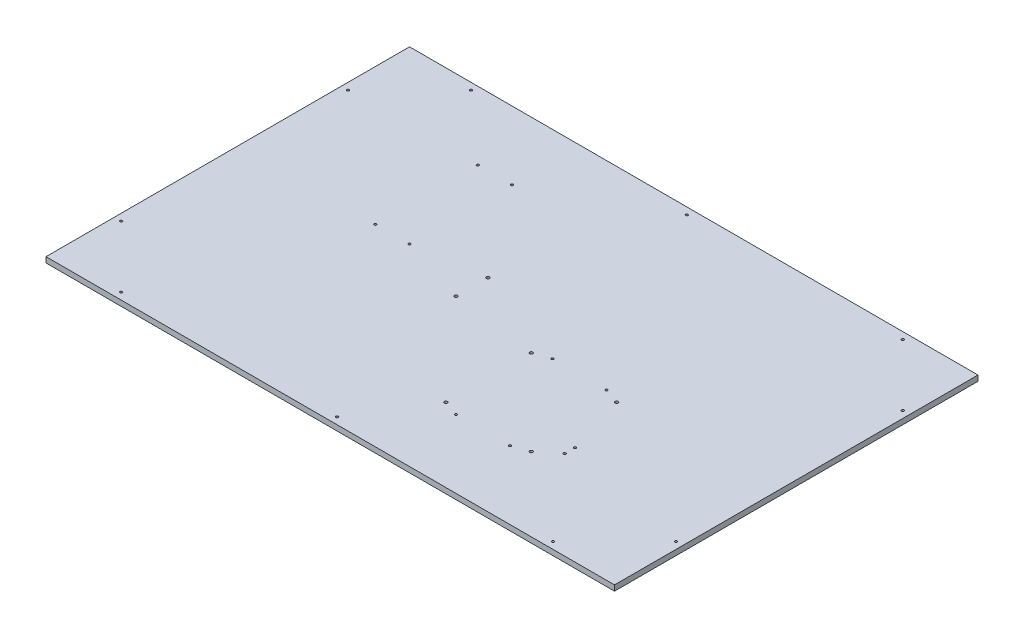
ISO-10303-21;
HEADER;
FILE_DESCRIPTION(('STEP AP214'),'2;1');
FILE_NAME('part.step','',(''),(''),'','','');
FILE_SCHEMA(('AUTOMOTIVE_DESIGN { 1 0 10303 214 1 1 1 1 }'));
ENDSEC;
DATA;
#1=APPLICATION_CONTEXT('core data for automotive mechanical design processes');
#2=APPLICATION_PROTOCOL_DEFINITION('international standard','automotive_design',2000,#1);
#3=PRODUCT_CONTEXT('',#1,'mechanical');
#4=PRODUCT('Part','Part','',(#3));
#5=PRODUCT_RELATED_PRODUCT_CATEGORY('part','',(#4));
#6=PRODUCT_DEFINITION_FORMATION('','',#4);
#7=PRODUCT_DEFINITION_CONTEXT('part definition',#1,'design');
#8=PRODUCT_DEFINITION('design','',#6,#7);
#9=PRODUCT_DEFINITION_SHAPE('','',#8);
#10=(LENGTH_UNIT() NAMED_UNIT(*) SI_UNIT(.MILLI.,.METRE.));
#11=(NAMED_UNIT(*) PLANE_ANGLE_UNIT() SI_UNIT($,.RADIAN.));
#12=(NAMED_UNIT(*) SI_UNIT($,.STERADIAN.) SOLID_ANGLE_UNIT());
#13=UNCERTAINTY_MEASURE_WITH_UNIT(LENGTH_MEASURE(1.E-05),#10,'distance_accuracy_value','');
#14=(GEOMETRIC_REPRESENTATION_CONTEXT(3) GLOBAL_UNCERTAINTY_ASSIGNED_CONTEXT((#13)) GLOBAL_UNIT_ASSIGNED_CONTEXT((#10,
#11,#12)) REPRESENTATION_CONTEXT('',''));
#15=CARTESIAN_POINT('',(0.,0.,0.));
#16=DIRECTION('',(0.,0.,1.));
#17=DIRECTION('',(1.,0.,0.));
#18=AXIS2_PLACEMENT_3D('',#15,#16,#17);
#19=CARTESIAN_POINT('',(416.,8.,266.));
#20=DIRECTION('',(-1.,0.,0.));
#21=DIRECTION('',(0.,0.,1.));
#22=AXIS2_PLACEMENT_3D('',#19,#20,#21);
#23=PLANE('',#22);
#24=DIRECTION('',(0.,0.,-1.));
#25=VECTOR('',#24,1.);
#26=CARTESIAN_POINT('',(416.,0.,266.));
#27=LINE('',#26,#25);
#28=CARTESIAN_POINT('',(416.,0.,266.));
#29=VERTEX_POINT('',#28);
#30=CARTESIAN_POINT('',(416.,0.,-266.));
#31=VERTEX_POINT('',#30);
#32=EDGE_CURVE('E106',#29,#31,#27,.T.);
#33=ORIENTED_EDGE('',*,*,#32,.T.);
#34=DIRECTION('',(0.,-1.,0.));
#35=VECTOR('',#34,1.);
#36=CARTESIAN_POINT('',(416.,8.,-266.));
#37=LINE('',#36,#35);
#38=CARTESIAN_POINT('',(416.,8.,-266.));
#39=VERTEX_POINT('',#38);
#40=EDGE_CURVE('E97',#39,#31,#37,.T.);
#41=ORIENTED_EDGE('',*,*,#40,.F.);
#42=DIRECTION('',(0.,0.,-1.));
#43=VECTOR('',#42,1.);
#44=CARTESIAN_POINT('',(416.,8.,266.));
#45=LINE('',#44,#43);
#46=CARTESIAN_POINT('',(416.,8.,266.));
#47=VERTEX_POINT('',#46);
#48=EDGE_CURVE('E91',#47,#39,#45,.T.);
#49=ORIENTED_EDGE('',*,*,#48,.F.);
#50=DIRECTION('',(0.,-1.,0.));
#51=VECTOR('',#50,1.);
#52=CARTESIAN_POINT('',(416.,8.,266.));
#53=LINE('',#52,#51);
#54=EDGE_CURVE('E102',#47,#29,#53,.T.);
#55=ORIENTED_EDGE('',*,*,#54,.T.);
#56=EDGE_LOOP('',(#33,#41,#49,#55));
#57=FACE_BOUND('',#56,.T.);
#58=ADVANCED_FACE('F37',(#57),#23,.F.);
#59=CARTESIAN_POINT('',(-416.,8.,-266.));
#60=DIRECTION('',(0.,0.,1.));
#61=DIRECTION('',(1.,0.,0.));
#62=AXIS2_PLACEMENT_3D('',#59,#60,#61);
#63=PLANE('',#62);
#64=DIRECTION('',(-1.,0.,0.));
#65=VECTOR('',#64,1.);
#66=CARTESIAN_POINT('',(-416.,0.,-266.));
#67=LINE('',#66,#65);
#68=CARTESIAN_POINT('',(-416.,0.,-266.));
#69=VERTEX_POINT('',#68);
#70=EDGE_CURVE('E96',#31,#69,#67,.T.);
#71=ORIENTED_EDGE('',*,*,#70,.T.);
#72=DIRECTION('',(0.,-1.,0.));
#73=VECTOR('',#72,1.);
#74=CARTESIAN_POINT('',(-416.,8.,-266.));
#75=LINE('',#74,#73);
#76=CARTESIAN_POINT('',(-416.,8.,-266.));
#77=VERTEX_POINT('',#76);
#78=EDGE_CURVE('E94',#77,#69,#75,.T.);
#79=ORIENTED_EDGE('',*,*,#78,.F.);
#80=DIRECTION('',(-1.,0.,0.));
#81=VECTOR('',#80,1.);
#82=CARTESIAN_POINT('',(-416.,8.,-266.));
#83=LINE('',#82,#81);
#84=EDGE_CURVE('E86',#39,#77,#83,.T.);
#85=ORIENTED_EDGE('',*,*,#84,.F.);
#86=ORIENTED_EDGE('',*,*,#40,.T.);
#87=EDGE_LOOP('',(#71,#79,#85,#86));
#88=FACE_BOUND('',#87,.T.);
#89=ADVANCED_FACE('F95',(#88),#63,.F.);
#90=CARTESIAN_POINT('',(-416.,8.,266.));
#91=DIRECTION('',(1.,0.,0.));
#92=DIRECTION('',(0.,0.,-1.));
#93=AXIS2_PLACEMENT_3D('',#90,#91,#92);
#94=PLANE('',#93);
#95=DIRECTION('',(0.,0.,1.));
#96=VECTOR('',#95,1.);
#97=CARTESIAN_POINT('',(-416.,0.,266.));
#98=LINE('',#97,#96);
#99=CARTESIAN_POINT('',(-416.,0.,266.));
#100=VERTEX_POINT('',#99);
#101=EDGE_CURVE('E72',#69,#100,#98,.T.);
#102=ORIENTED_EDGE('',*,*,#101,.T.);
#103=DIRECTION('',(0.,-1.,0.));
#104=VECTOR('',#103,1.);
#105=CARTESIAN_POINT('',(-416.,8.,266.));
#106=LINE('',#105,#104);
#107=CARTESIAN_POINT('',(-416.,8.,266.));
#108=VERTEX_POINT('',#107);
#109=EDGE_CURVE('E98',#108,#100,#106,.T.);
#110=ORIENTED_EDGE('',*,*,#109,.F.);
#111=DIRECTION('',(0.,0.,1.));
#112=VECTOR('',#111,1.);
#113=CARTESIAN_POINT('',(-416.,8.,266.));
#114=LINE('',#113,#112);
#115=EDGE_CURVE('E89',#77,#108,#114,.T.);
#116=ORIENTED_EDGE('',*,*,#115,.F.);
#117=ORIENTED_EDGE('',*,*,#78,.T.);
#118=EDGE_LOOP('',(#102,#110,#116,#117));
#119=FACE_BOUND('',#118,.T.);
#120=ADVANCED_FACE('F100',(#119),#94,.F.);
#121=CARTESIAN_POINT('',(-416.,8.,266.));
#122=DIRECTION('',(0.,0.,-1.));
#123=DIRECTION('',(-1.,0.,0.));
#124=AXIS2_PLACEMENT_3D('',#121,#122,#123);
#125=PLANE('',#124);
#126=DIRECTION('',(1.,0.,0.));
#127=VECTOR('',#126,1.);
#128=CARTESIAN_POINT('',(-416.,0.,266.));
#129=LINE('',#128,#127);
#130=EDGE_CURVE('E78',#100,#29,#129,.T.);
#131=ORIENTED_EDGE('',*,*,#130,.T.);
#132=ORIENTED_EDGE('',*,*,#54,.F.);
#133=DIRECTION('',(1.,0.,0.));
#134=VECTOR('',#133,1.);
#135=CARTESIAN_POINT('',(-416.,8.,266.));
#136=LINE('',#135,#134);
#137=EDGE_CURVE('E55',#108,#47,#136,.T.);
#138=ORIENTED_EDGE('',*,*,#137,.F.);
#139=ORIENTED_EDGE('',*,*,#109,.T.);
#140=EDGE_LOOP('',(#131,#132,#138,#139));
#141=FACE_BOUND('',#140,.T.);
#142=ADVANCED_FACE('F327',(#141),#125,.F.);
#143=CARTESIAN_POINT('',(0.,8.,0.));
#144=DIRECTION('',(0.,-1.,0.));
#145=DIRECTION('',(0.,0.,-1.));
#146=AXIS2_PLACEMENT_3D('',#143,#144,#145);
#147=PLANE('',#146);
#148=CARTESIAN_POINT('',(-406.,8.,-166.));
#149=DIRECTION('',(0.,1.,0.));
#150=DIRECTION('',(0.,0.,1.));
#151=AXIS2_PLACEMENT_3D('',#148,#149,#150);
#152=CIRCLE('',#151,1.74999999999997);
#153=CARTESIAN_POINT('',(-406.,8.,-164.25));
#154=VERTEX_POINT('',#153);
#155=EDGE_CURVE('E682',#154,#154,#152,.T.);
#156=ORIENTED_EDGE('',*,*,#155,.F.);
#157=EDGE_LOOP('',(#156));
#158=FACE_BOUND('',#157,.T.);
#159=CARTESIAN_POINT('',(-406.,8.,166.));
#160=DIRECTION('',(0.,1.,0.));
#161=DIRECTION('',(0.,0.,1.));
#162=AXIS2_PLACEMENT_3D('',#159,#160,#161);
#163=CIRCLE('',#162,1.74999999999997);
#164=CARTESIAN_POINT('',(-406.,8.,167.75));
#165=VERTEX_POINT('',#164);
#166=EDGE_CURVE('E683',#165,#165,#163,.T.);
#167=ORIENTED_EDGE('',*,*,#166,.F.);
#168=EDGE_LOOP('',(#167));
#169=FACE_BOUND('',#168,.T.);
#170=CARTESIAN_POINT('',(-316.,8.,256.));
#171=DIRECTION('',(0.,1.,0.));
#172=DIRECTION('',(0.,0.,1.));
#173=AXIS2_PLACEMENT_3D('',#170,#171,#172);
#174=CIRCLE('',#173,1.74999999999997);
#175=CARTESIAN_POINT('',(-316.,8.,257.75));
#176=VERTEX_POINT('',#175);
#177=EDGE_CURVE('E686',#176,#176,#174,.T.);
#178=ORIENTED_EDGE('',*,*,#177,.F.);
#179=EDGE_LOOP('',(#178));
#180=FACE_BOUND('',#179,.T.);
#181=CARTESIAN_POINT('',(0.,8.,256.));
#182=DIRECTION('',(0.,1.,0.));
#183=DIRECTION('',(0.,0.,1.));
#184=AXIS2_PLACEMENT_3D('',#181,#182,#183);
#185=CIRCLE('',#184,1.75);
#186=CARTESIAN_POINT('',(0.,8.,257.75));
#187=VERTEX_POINT('',#186);
#188=EDGE_CURVE('E691',#187,#187,#185,.T.);
#189=ORIENTED_EDGE('',*,*,#188,.F.);
#190=EDGE_LOOP('',(#189));
#191=FACE_BOUND('',#190,.T.);
#192=CARTESIAN_POINT('',(316.,8.,256.));
#193=DIRECTION('',(0.,1.,0.));
#194=DIRECTION('',(0.,0.,1.));
#195=AXIS2_PLACEMENT_3D('',#192,#193,#194);
#196=CIRCLE('',#195,1.74999999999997);
#197=CARTESIAN_POINT('',(316.,8.,257.75));
#198=VERTEX_POINT('',#197);
#199=EDGE_CURVE('E694',#198,#198,#196,.T.);
#200=ORIENTED_EDGE('',*,*,#199,.F.);
#201=EDGE_LOOP('',(#200));
#202=FACE_BOUND('',#201,.T.);
#203=CARTESIAN_POINT('',(406.,8.,166.));
#204=DIRECTION('',(0.,1.,0.));
#205=DIRECTION('',(0.,0.,1.));
#206=AXIS2_PLACEMENT_3D('',#203,#204,#205);
#207=CIRCLE('',#206,1.74999999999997);
#208=CARTESIAN_POINT('',(406.,8.,167.75));
#209=VERTEX_POINT('',#208);
#210=EDGE_CURVE('E697',#209,#209,#207,.T.);
#211=ORIENTED_EDGE('',*,*,#210,.F.);
#212=EDGE_LOOP('',(#211));
#213=FACE_BOUND('',#212,.T.);
#214=CARTESIAN_POINT('',(406.,8.,-166.));
#215=DIRECTION('',(0.,1.,0.));
#216=DIRECTION('',(0.,0.,1.));
#217=AXIS2_PLACEMENT_3D('',#214,#215,#216);
#218=CIRCLE('',#217,1.74999999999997);
#219=CARTESIAN_POINT('',(406.,8.,-164.25));
#220=VERTEX_POINT('',#219);
#221=EDGE_CURVE('E700',#220,#220,#218,.T.);
#222=ORIENTED_EDGE('',*,*,#221,.F.);
#223=EDGE_LOOP('',(#222));
#224=FACE_BOUND('',#223,.T.);
#225=CARTESIAN_POINT('',(316.,8.,-256.));
#226=DIRECTION('',(0.,1.,0.));
#227=DIRECTION('',(0.,0.,1.));
#228=AXIS2_PLACEMENT_3D('',#225,#226,#227);
#229=CIRCLE('',#228,1.74999999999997);
#230=CARTESIAN_POINT('',(316.,8.,-254.25));
#231=VERTEX_POINT('',#230);
#232=EDGE_CURVE('E703',#231,#231,#229,.T.);
#233=ORIENTED_EDGE('',*,*,#232,.F.);
#234=EDGE_LOOP('',(#233));
#235=FACE_BOUND('',#234,.T.);
#236=CARTESIAN_POINT('',(0.,8.,-256.));
#237=DIRECTION('',(0.,1.,0.));
#238=DIRECTION('',(0.,0.,1.));
#239=AXIS2_PLACEMENT_3D('',#236,#237,#238);
#240=CIRCLE('',#239,1.75);
#241=CARTESIAN_POINT('',(0.,8.,-254.25));
#242=VERTEX_POINT('',#241);
#243=EDGE_CURVE('E706',#242,#242,#240,.T.);
#244=ORIENTED_EDGE('',*,*,#243,.F.);
#245=EDGE_LOOP('',(#244));
#246=FACE_BOUND('',#245,.T.);
#247=CARTESIAN_POINT('',(-316.,8.,-256.));
#248=DIRECTION('',(0.,1.,0.));
#249=DIRECTION('',(0.,0.,1.));
#250=AXIS2_PLACEMENT_3D('',#247,#248,#249);
#251=CIRCLE('',#250,1.74999999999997);
#252=CARTESIAN_POINT('',(-316.,8.,-254.25));
#253=VERTEX_POINT('',#252);
#254=EDGE_CURVE('E709',#253,#253,#251,.T.);
#255=ORIENTED_EDGE('',*,*,#254,.F.);
#256=EDGE_LOOP('',(#255));
#257=FACE_BOUND('',#256,.T.);
#258=CARTESIAN_POINT('',(213.1,8.,136.));
#259=DIRECTION('',(0.,1.,0.));
#260=DIRECTION('',(0.,0.,1.));
#261=AXIS2_PLACEMENT_3D('',#258,#259,#260);
#262=CIRCLE('',#261,1.75);
#263=CARTESIAN_POINT('',(213.1,8.,137.75));
#264=VERTEX_POINT('',#263);
#265=EDGE_CURVE('E540',#264,#264,#262,.T.);
#266=ORIENTED_EDGE('',*,*,#265,.F.);
#267=EDGE_LOOP('',(#266));
#268=FACE_BOUND('',#267,.T.);
#269=CARTESIAN_POINT('',(213.1,8.,121.));
#270=DIRECTION('',(0.,1.,0.));
#271=DIRECTION('',(0.,0.,1.));
#272=AXIS2_PLACEMENT_3D('',#269,#270,#271);
#273=CIRCLE('',#272,1.75);
#274=CARTESIAN_POINT('',(213.1,8.,122.75));
#275=VERTEX_POINT('',#274);
#276=EDGE_CURVE('E534',#275,#275,#273,.T.);
#277=ORIENTED_EDGE('',*,*,#276,.F.);
#278=EDGE_LOOP('',(#277));
#279=FACE_BOUND('',#278,.T.);
#280=CARTESIAN_POINT('',(61.05,8.,32.9));
#281=DIRECTION('',(0.,1.,0.));
#282=DIRECTION('',(0.,0.,1.));
#283=AXIS2_PLACEMENT_3D('',#280,#281,#282);
#284=CIRCLE('',#283,2.25);
#285=CARTESIAN_POINT('',(61.05,8.,35.15));
#286=VERTEX_POINT('',#285);
#287=EDGE_CURVE('E531',#286,#286,#284,.T.);
#288=ORIENTED_EDGE('',*,*,#287,.F.);
#289=EDGE_LOOP('',(#288));
#290=FACE_BOUND('',#289,.T.);
#291=CARTESIAN_POINT('',(186.05,8.,32.9));
#292=DIRECTION('',(0.,1.,0.));
#293=DIRECTION('',(0.,0.,1.));
#294=AXIS2_PLACEMENT_3D('',#291,#292,#293);
#295=CIRCLE('',#294,2.25);
#296=CARTESIAN_POINT('',(186.05,8.,35.15));
#297=VERTEX_POINT('',#296);
#298=EDGE_CURVE('E533',#297,#297,#295,.T.);
#299=ORIENTED_EDGE('',*,*,#298,.F.);
#300=EDGE_LOOP('',(#299));
#301=FACE_BOUND('',#300,.T.);
#302=CARTESIAN_POINT('',(186.05,8.,157.9));
#303=DIRECTION('',(0.,1.,0.));
#304=DIRECTION('',(0.,0.,1.));
#305=AXIS2_PLACEMENT_3D('',#302,#303,#304);
#306=CIRCLE('',#305,2.25);
#307=CARTESIAN_POINT('',(186.05,8.,160.15));
#308=VERTEX_POINT('',#307);
#309=EDGE_CURVE('E537',#308,#308,#306,.T.);
#310=ORIENTED_EDGE('',*,*,#309,.F.);
#311=EDGE_LOOP('',(#310));
#312=FACE_BOUND('',#311,.T.);
#313=CARTESIAN_POINT('',(61.05,8.,157.9));
#314=DIRECTION('',(0.,1.,0.));
#315=DIRECTION('',(0.,0.,1.));
#316=AXIS2_PLACEMENT_3D('',#313,#314,#315);
#317=CIRCLE('',#316,2.25);
#318=CARTESIAN_POINT('',(61.05,8.,160.15));
#319=VERTEX_POINT('',#318);
#320=EDGE_CURVE('E546',#319,#319,#317,.T.);
#321=ORIENTED_EDGE('',*,*,#320,.F.);
#322=EDGE_LOOP('',(#321));
#323=FACE_BOUND('',#322,.T.);
#324=CARTESIAN_POINT('',(-66.,8.,-30.75));
#325=DIRECTION('',(0.,1.,0.));
#326=DIRECTION('',(0.,0.,1.));
#327=AXIS2_PLACEMENT_3D('',#324,#325,#326);
#328=CIRCLE('',#327,2.25);
#329=CARTESIAN_POINT('',(-66.,8.,-28.5));
#330=VERTEX_POINT('',#329);
#331=EDGE_CURVE('E549',#330,#330,#328,.T.);
#332=ORIENTED_EDGE('',*,*,#331,.F.);
#333=EDGE_LOOP('',(#332));
#334=FACE_BOUND('',#333,.T.);
#335=CARTESIAN_POINT('',(-66.,8.,16.));
#336=DIRECTION('',(0.,1.,0.));
#337=DIRECTION('',(0.,0.,1.));
#338=AXIS2_PLACEMENT_3D('',#335,#336,#337);
#339=CIRCLE('',#338,2.25);
#340=CARTESIAN_POINT('',(-66.,8.,18.25));
#341=VERTEX_POINT('',#340);
#342=EDGE_CURVE('E552',#341,#341,#339,.T.);
#343=ORIENTED_EDGE('',*,*,#342,.F.);
#344=EDGE_LOOP('',(#343));
#345=FACE_BOUND('',#344,.T.);
#346=CARTESIAN_POINT('',(-216.,8.,-166.));
#347=DIRECTION('',(0.,1.,0.));
#348=DIRECTION('',(0.,0.,1.));
#349=AXIS2_PLACEMENT_3D('',#346,#347,#348);
#350=CIRCLE('',#349,1.75);
#351=CARTESIAN_POINT('',(-216.,8.,-164.25));
#352=VERTEX_POINT('',#351);
#353=EDGE_CURVE('E555',#352,#352,#350,.T.);
#354=ORIENTED_EDGE('',*,*,#353,.F.);
#355=EDGE_LOOP('',(#354));
#356=FACE_BOUND('',#355,.T.);
#357=CARTESIAN_POINT('',(-166.,8.,-166.));
#358=DIRECTION('',(0.,1.,0.));
#359=DIRECTION('',(0.,0.,1.));
#360=AXIS2_PLACEMENT_3D('',#357,#358,#359);
#361=CIRCLE('',#360,1.75);
#362=CARTESIAN_POINT('',(-166.,8.,-164.25));
#363=VERTEX_POINT('',#362);
#364=EDGE_CURVE('E558',#363,#363,#361,.T.);
#365=ORIENTED_EDGE('',*,*,#364,.F.);
#366=EDGE_LOOP('',(#365));
#367=FACE_BOUND('',#366,.T.);
#368=CARTESIAN_POINT('',(-166.,8.,-16.));
#369=DIRECTION('',(0.,1.,0.));
#370=DIRECTION('',(0.,0.,1.));
#371=AXIS2_PLACEMENT_3D('',#368,#369,#370);
#372=CIRCLE('',#371,1.75);
#373=CARTESIAN_POINT('',(-166.,8.,-14.25));
#374=VERTEX_POINT('',#373);
#375=EDGE_CURVE('E561',#374,#374,#372,.T.);
#376=ORIENTED_EDGE('',*,*,#375,.F.);
#377=EDGE_LOOP('',(#376));
#378=FACE_BOUND('',#377,.T.);
#379=CARTESIAN_POINT('',(-216.,8.,-16.));
#380=DIRECTION('',(0.,1.,0.));
#381=DIRECTION('',(0.,0.,1.));
#382=AXIS2_PLACEMENT_3D('',#379,#380,#381);
#383=CIRCLE('',#382,1.75);
#384=CARTESIAN_POINT('',(-216.,8.,-14.25));
#385=VERTEX_POINT('',#384);
#386=EDGE_CURVE('E564',#385,#385,#383,.T.);
#387=ORIENTED_EDGE('',*,*,#386,.F.);
#388=EDGE_LOOP('',(#387));
#389=FACE_BOUND('',#388,.T.);
#390=CARTESIAN_POINT('',(84.,8.,24.8));
#391=DIRECTION('',(0.,1.,0.));
#392=DIRECTION('',(0.,0.,1.));
#393=AXIS2_PLACEMENT_3D('',#390,#391,#392);
#394=CIRCLE('',#393,1.74999999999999);
#395=CARTESIAN_POINT('',(84.,8.,26.55));
#396=VERTEX_POINT('',#395);
#397=EDGE_CURVE('E567',#396,#396,#394,.T.);
#398=ORIENTED_EDGE('',*,*,#397,.F.);
#399=EDGE_LOOP('',(#398));
#400=FACE_BOUND('',#399,.T.);
#401=CARTESIAN_POINT('',(163.1,8.,24.8));
#402=DIRECTION('',(0.,1.,0.));
#403=DIRECTION('',(0.,0.,1.));
#404=AXIS2_PLACEMENT_3D('',#401,#402,#403);
#405=CIRCLE('',#404,1.75);
#406=CARTESIAN_POINT('',(163.1,8.,26.55));
#407=VERTEX_POINT('',#406);
#408=EDGE_CURVE('E570',#407,#407,#405,.T.);
#409=ORIENTED_EDGE('',*,*,#408,.F.);
#410=EDGE_LOOP('',(#409));
#411=FACE_BOUND('',#410,.T.);
#412=CARTESIAN_POINT('',(163.1,8.,166.));
#413=DIRECTION('',(0.,1.,0.));
#414=DIRECTION('',(0.,0.,1.));
#415=AXIS2_PLACEMENT_3D('',#412,#413,#414);
#416=CIRCLE('',#415,1.75);
#417=CARTESIAN_POINT('',(163.1,8.,167.75));
#418=VERTEX_POINT('',#417);
#419=EDGE_CURVE('E573',#418,#418,#416,.T.);
#420=ORIENTED_EDGE('',*,*,#419,.F.);
#421=EDGE_LOOP('',(#420));
#422=FACE_BOUND('',#421,.T.);
#423=CARTESIAN_POINT('',(84.,8.,166.));
#424=DIRECTION('',(0.,1.,0.));
#425=DIRECTION('',(0.,0.,1.));
#426=AXIS2_PLACEMENT_3D('',#423,#424,#425);
#427=CIRCLE('',#426,1.74999999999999);
#428=CARTESIAN_POINT('',(84.,8.,167.75));
#429=VERTEX_POINT('',#428);
#430=EDGE_CURVE('E109',#429,#429,#427,.T.);
#431=ORIENTED_EDGE('',*,*,#430,.F.);
#432=EDGE_LOOP('',(#431));
#433=FACE_BOUND('',#432,.T.);
#434=ORIENTED_EDGE('',*,*,#48,.T.);
#435=ORIENTED_EDGE('',*,*,#84,.T.);
#436=ORIENTED_EDGE('',*,*,#115,.T.);
#437=ORIENTED_EDGE('',*,*,#137,.T.);
#438=EDGE_LOOP('',(#434,#435,#436,#437));
#439=FACE_BOUND('',#438,.T.);
#440=ADVANCED_FACE('F87',(#158,#169,#180,#191,#202,#213,#224,#235,#246,#257,#268,#279,#290,#301,
#312,#323,#334,#345,#356,#367,#378,#389,#400,#411,#422,#433,#439),#147,.F.);
#441=CARTESIAN_POINT('',(0.,0.,0.));
#442=DIRECTION('',(0.,-1.,0.));
#443=DIRECTION('',(0.,0.,-1.));
#444=AXIS2_PLACEMENT_3D('',#441,#442,#443);
#445=PLANE('',#444);
#446=CARTESIAN_POINT('',(186.05,0.,32.9));
#447=DIRECTION('',(0.,-1.,0.));
#448=DIRECTION('',(0.,0.,-1.));
#449=AXIS2_PLACEMENT_3D('',#446,#447,#448);
#450=CIRCLE('',#449,4.75000000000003);
#451=CARTESIAN_POINT('',(186.05,0.,28.15));
#452=VERTEX_POINT('',#451);
#453=EDGE_CURVE('E251',#452,#452,#450,.F.);
#454=ORIENTED_EDGE('',*,*,#453,.T.);
#455=EDGE_LOOP('',(#454));
#456=FACE_BOUND('',#455,.T.);
#457=CARTESIAN_POINT('',(186.05,0.,157.9));
#458=DIRECTION('',(0.,-1.,0.));
#459=DIRECTION('',(0.,0.,-1.));
#460=AXIS2_PLACEMENT_3D('',#457,#458,#459);
#461=CIRCLE('',#460,4.74999999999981);
#462=CARTESIAN_POINT('',(186.05,0.,153.15));
#463=VERTEX_POINT('',#462);
#464=EDGE_CURVE('E248',#463,#463,#461,.F.);
#465=ORIENTED_EDGE('',*,*,#464,.T.);
#466=EDGE_LOOP('',(#465));
#467=FACE_BOUND('',#466,.T.);
#468=CARTESIAN_POINT('',(61.05,0.,157.9));
#469=DIRECTION('',(0.,-1.,0.));
#470=DIRECTION('',(0.,0.,-1.));
#471=AXIS2_PLACEMENT_3D('',#468,#469,#470);
#472=CIRCLE('',#471,4.74999999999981);
#473=CARTESIAN_POINT('',(61.05,0.,153.15));
#474=VERTEX_POINT('',#473);
#475=EDGE_CURVE('E245',#474,#474,#472,.F.);
#476=ORIENTED_EDGE('',*,*,#475,.T.);
#477=EDGE_LOOP('',(#476));
#478=FACE_BOUND('',#477,.T.);
#479=CARTESIAN_POINT('',(61.05,0.,32.9));
#480=DIRECTION('',(0.,-1.,0.));
#481=DIRECTION('',(0.,0.,-1.));
#482=AXIS2_PLACEMENT_3D('',#479,#480,#481);
#483=CIRCLE('',#482,4.75000000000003);
#484=CARTESIAN_POINT('',(61.05,0.,28.15));
#485=VERTEX_POINT('',#484);
#486=EDGE_CURVE('E242',#485,#485,#483,.F.);
#487=ORIENTED_EDGE('',*,*,#486,.T.);
#488=EDGE_LOOP('',(#487));
#489=FACE_BOUND('',#488,.T.);
#490=CARTESIAN_POINT('',(-66.,0.,16.));
#491=DIRECTION('',(0.,-1.,0.));
#492=DIRECTION('',(0.,0.,-1.));
#493=AXIS2_PLACEMENT_3D('',#490,#491,#492);
#494=CIRCLE('',#493,4.74999999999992);
#495=CARTESIAN_POINT('',(-66.,0.,11.2500000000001));
#496=VERTEX_POINT('',#495);
#497=EDGE_CURVE('E239',#496,#496,#494,.F.);
#498=ORIENTED_EDGE('',*,*,#497,.T.);
#499=EDGE_LOOP('',(#498));
#500=FACE_BOUND('',#499,.T.);
#501=CARTESIAN_POINT('',(-66.,0.,-30.75));
#502=DIRECTION('',(0.,-1.,0.));
#503=DIRECTION('',(0.,0.,-1.));
#504=AXIS2_PLACEMENT_3D('',#501,#502,#503);
#505=CIRCLE('',#504,4.74999999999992);
#506=CARTESIAN_POINT('',(-66.,0.,-35.4999999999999));
#507=VERTEX_POINT('',#506);
#508=EDGE_CURVE('E236',#507,#507,#505,.F.);
#509=ORIENTED_EDGE('',*,*,#508,.T.);
#510=EDGE_LOOP('',(#509));
#511=FACE_BOUND('',#510,.T.);
#512=CARTESIAN_POINT('',(213.1,0.,121.));
#513=DIRECTION('',(0.,-1.,0.));
#514=DIRECTION('',(0.,0.,-1.));
#515=AXIS2_PLACEMENT_3D('',#512,#513,#514);
#516=CIRCLE('',#515,3.24999999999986);
#517=CARTESIAN_POINT('',(213.1,0.,117.75));
#518=VERTEX_POINT('',#517);
#519=EDGE_CURVE('E173',#518,#518,#516,.F.);
#520=ORIENTED_EDGE('',*,*,#519,.T.);
#521=EDGE_LOOP('',(#520));
#522=FACE_BOUND('',#521,.T.);
#523=CARTESIAN_POINT('',(213.1,0.,136.));
#524=DIRECTION('',(0.,-1.,0.));
#525=DIRECTION('',(0.,0.,-1.));
#526=AXIS2_PLACEMENT_3D('',#523,#524,#525);
#527=CIRCLE('',#526,3.25000000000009);
#528=CARTESIAN_POINT('',(213.1,0.,132.75));
#529=VERTEX_POINT('',#528);
#530=EDGE_CURVE('E170',#529,#529,#527,.F.);
#531=ORIENTED_EDGE('',*,*,#530,.T.);
#532=EDGE_LOOP('',(#531));
#533=FACE_BOUND('',#532,.T.);
#534=CARTESIAN_POINT('',(163.1,0.,24.8));
#535=DIRECTION('',(0.,-1.,0.));
#536=DIRECTION('',(0.,0.,-1.));
#537=AXIS2_PLACEMENT_3D('',#534,#535,#536);
#538=CIRCLE('',#537,3.24999999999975);
#539=CARTESIAN_POINT('',(163.1,0.,21.5500000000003));
#540=VERTEX_POINT('',#539);
#541=EDGE_CURVE('E167',#540,#540,#538,.F.);
#542=ORIENTED_EDGE('',*,*,#541,.T.);
#543=EDGE_LOOP('',(#542));
#544=FACE_BOUND('',#543,.T.);
#545=CARTESIAN_POINT('',(84.,0.,24.8));
#546=DIRECTION('',(0.,-1.,0.));
#547=DIRECTION('',(0.,0.,-1.));
#548=AXIS2_PLACEMENT_3D('',#545,#546,#547);
#549=CIRCLE('',#548,3.24999999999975);
#550=CARTESIAN_POINT('',(84.,0.,21.5500000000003));
#551=VERTEX_POINT('',#550);
#552=EDGE_CURVE('E164',#551,#551,#549,.F.);
#553=ORIENTED_EDGE('',*,*,#552,.T.);
#554=EDGE_LOOP('',(#553));
#555=FACE_BOUND('',#554,.T.);
#556=CARTESIAN_POINT('',(163.1,0.,166.));
#557=DIRECTION('',(0.,-1.,0.));
#558=DIRECTION('',(0.,0.,-1.));
#559=AXIS2_PLACEMENT_3D('',#556,#557,#558);
#560=CIRCLE('',#559,3.25000000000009);
#561=CARTESIAN_POINT('',(163.1,0.,162.75));
#562=VERTEX_POINT('',#561);
#563=EDGE_CURVE('E161',#562,#562,#560,.F.);
#564=ORIENTED_EDGE('',*,*,#563,.T.);
#565=EDGE_LOOP('',(#564));
#566=FACE_BOUND('',#565,.T.);
#567=CARTESIAN_POINT('',(84.,0.,166.));
#568=DIRECTION('',(0.,-1.,0.));
#569=DIRECTION('',(0.,0.,-1.));
#570=AXIS2_PLACEMENT_3D('',#567,#568,#569);
#571=CIRCLE('',#570,3.25000000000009);
#572=CARTESIAN_POINT('',(84.,0.,162.75));
#573=VERTEX_POINT('',#572);
#574=EDGE_CURVE('E158',#573,#573,#571,.F.);
#575=ORIENTED_EDGE('',*,*,#574,.T.);
#576=EDGE_LOOP('',(#575));
#577=FACE_BOUND('',#576,.T.);
#578=CARTESIAN_POINT('',(-166.,0.,-166.));
#579=DIRECTION('',(0.,-1.,0.));
#580=DIRECTION('',(0.,0.,-1.));
#581=AXIS2_PLACEMENT_3D('',#578,#579,#580);
#582=CIRCLE('',#581,3.25000000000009);
#583=CARTESIAN_POINT('',(-166.,0.,-169.25));
#584=VERTEX_POINT('',#583);
#585=EDGE_CURVE('E155',#584,#584,#582,.F.);
#586=ORIENTED_EDGE('',*,*,#585,.T.);
#587=EDGE_LOOP('',(#586));
#588=FACE_BOUND('',#587,.T.);
#589=CARTESIAN_POINT('',(-216.,0.,-166.));
#590=DIRECTION('',(0.,-1.,0.));
#591=DIRECTION('',(0.,0.,-1.));
#592=AXIS2_PLACEMENT_3D('',#589,#590,#591);
#593=CIRCLE('',#592,3.25000000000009);
#594=CARTESIAN_POINT('',(-216.,0.,-169.25));
#595=VERTEX_POINT('',#594);
#596=EDGE_CURVE('E152',#595,#595,#593,.F.);
#597=ORIENTED_EDGE('',*,*,#596,.T.);
#598=EDGE_LOOP('',(#597));
#599=FACE_BOUND('',#598,.T.);
#600=CARTESIAN_POINT('',(-166.,0.,-16.));
#601=DIRECTION('',(0.,-1.,0.));
#602=DIRECTION('',(0.,0.,-1.));
#603=AXIS2_PLACEMENT_3D('',#600,#601,#602);
#604=CIRCLE('',#603,3.24999999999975);
#605=CARTESIAN_POINT('',(-166.,0.,-19.2499999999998));
#606=VERTEX_POINT('',#605);
#607=EDGE_CURVE('E149',#606,#606,#604,.F.);
#608=ORIENTED_EDGE('',*,*,#607,.T.);
#609=EDGE_LOOP('',(#608));
#610=FACE_BOUND('',#609,.T.);
#611=CARTESIAN_POINT('',(-216.,0.,-16.));
#612=DIRECTION('',(0.,-1.,0.));
#613=DIRECTION('',(0.,0.,-1.));
#614=AXIS2_PLACEMENT_3D('',#611,#612,#613);
#615=CIRCLE('',#614,3.24999999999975);
#616=CARTESIAN_POINT('',(-216.,0.,-19.2499999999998));
#617=VERTEX_POINT('',#616);
#618=EDGE_CURVE('E146',#617,#617,#615,.F.);
#619=ORIENTED_EDGE('',*,*,#618,.T.);
#620=EDGE_LOOP('',(#619));
#621=FACE_BOUND('',#620,.T.);
#622=CARTESIAN_POINT('',(0.,0.,256.));
#623=DIRECTION('',(0.,-1.,0.));
#624=DIRECTION('',(0.,0.,-1.));
#625=AXIS2_PLACEMENT_3D('',#622,#623,#624);
#626=CIRCLE('',#625,3.24999999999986);
#627=CARTESIAN_POINT('',(0.,0.,252.75));
#628=VERTEX_POINT('',#627);
#629=EDGE_CURVE('E143',#628,#628,#626,.F.);
#630=ORIENTED_EDGE('',*,*,#629,.T.);
#631=EDGE_LOOP('',(#630));
#632=FACE_BOUND('',#631,.T.);
#633=CARTESIAN_POINT('',(316.,0.,256.));
#634=DIRECTION('',(0.,-1.,0.));
#635=DIRECTION('',(0.,0.,-1.));
#636=AXIS2_PLACEMENT_3D('',#633,#634,#635);
#637=CIRCLE('',#636,3.24999999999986);
#638=CARTESIAN_POINT('',(316.,0.,252.75));
#639=VERTEX_POINT('',#638);
#640=EDGE_CURVE('E140',#639,#639,#637,.F.);
#641=ORIENTED_EDGE('',*,*,#640,.T.);
#642=EDGE_LOOP('',(#641));
#643=FACE_BOUND('',#642,.T.);
#644=CARTESIAN_POINT('',(406.,0.,166.));
#645=DIRECTION('',(0.,-1.,0.));
#646=DIRECTION('',(0.,0.,-1.));
#647=AXIS2_PLACEMENT_3D('',#644,#645,#646);
#648=CIRCLE('',#647,3.24999999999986);
#649=CARTESIAN_POINT('',(406.,0.,162.75));
#650=VERTEX_POINT('',#649);
#651=EDGE_CURVE('E137',#650,#650,#648,.F.);
#652=ORIENTED_EDGE('',*,*,#651,.T.);
#653=EDGE_LOOP('',(#652));
#654=FACE_BOUND('',#653,.T.);
#655=CARTESIAN_POINT('',(406.,0.,-166.));
#656=DIRECTION('',(0.,-1.,0.));
#657=DIRECTION('',(0.,0.,-1.));
#658=AXIS2_PLACEMENT_3D('',#655,#656,#657);
#659=CIRCLE('',#658,3.24999999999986);
#660=CARTESIAN_POINT('',(406.,0.,-169.25));
#661=VERTEX_POINT('',#660);
#662=EDGE_CURVE('E134',#661,#661,#659,.F.);
#663=ORIENTED_EDGE('',*,*,#662,.T.);
#664=EDGE_LOOP('',(#663));
#665=FACE_BOUND('',#664,.T.);
#666=CARTESIAN_POINT('',(316.,0.,-256.));
#667=DIRECTION('',(0.,-1.,0.));
#668=DIRECTION('',(0.,0.,-1.));
#669=AXIS2_PLACEMENT_3D('',#666,#667,#668);
#670=CIRCLE('',#669,3.24999999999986);
#671=CARTESIAN_POINT('',(316.,0.,-259.25));
#672=VERTEX_POINT('',#671);
#673=EDGE_CURVE('E131',#672,#672,#670,.F.);
#674=ORIENTED_EDGE('',*,*,#673,.T.);
#675=EDGE_LOOP('',(#674));
#676=FACE_BOUND('',#675,.T.);
#677=CARTESIAN_POINT('',(0.,0.,-256.));
#678=DIRECTION('',(0.,-1.,0.));
#679=DIRECTION('',(0.,0.,-1.));
#680=AXIS2_PLACEMENT_3D('',#677,#678,#679);
#681=CIRCLE('',#680,3.24999999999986);
#682=CARTESIAN_POINT('',(0.,0.,-259.25));
#683=VERTEX_POINT('',#682);
#684=EDGE_CURVE('E128',#683,#683,#681,.F.);
#685=ORIENTED_EDGE('',*,*,#684,.T.);
#686=EDGE_LOOP('',(#685));
#687=FACE_BOUND('',#686,.T.);
#688=CARTESIAN_POINT('',(-316.,0.,-256.));
#689=DIRECTION('',(0.,-1.,0.));
#690=DIRECTION('',(0.,0.,-1.));
#691=AXIS2_PLACEMENT_3D('',#688,#689,#690);
#692=CIRCLE('',#691,3.24999999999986);
#693=CARTESIAN_POINT('',(-316.,0.,-259.25));
#694=VERTEX_POINT('',#693);
#695=EDGE_CURVE('E125',#694,#694,#692,.F.);
#696=ORIENTED_EDGE('',*,*,#695,.T.);
#697=EDGE_LOOP('',(#696));
#698=FACE_BOUND('',#697,.T.);
#699=CARTESIAN_POINT('',(-406.,0.,-166.));
#700=DIRECTION('',(0.,-1.,0.));
#701=DIRECTION('',(0.,0.,-1.));
#702=AXIS2_PLACEMENT_3D('',#699,#700,#701);
#703=CIRCLE('',#702,3.24999999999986);
#704=CARTESIAN_POINT('',(-406.,0.,-169.25));
#705=VERTEX_POINT('',#704);
#706=EDGE_CURVE('E122',#705,#705,#703,.F.);
#707=ORIENTED_EDGE('',*,*,#706,.T.);
#708=EDGE_LOOP('',(#707));
#709=FACE_BOUND('',#708,.T.);
#710=CARTESIAN_POINT('',(-406.,0.,166.));
#711=DIRECTION('',(0.,-1.,0.));
#712=DIRECTION('',(0.,0.,-1.));
#713=AXIS2_PLACEMENT_3D('',#710,#711,#712);
#714=CIRCLE('',#713,3.24999999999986);
#715=CARTESIAN_POINT('',(-406.,0.,162.75));
#716=VERTEX_POINT('',#715);
#717=EDGE_CURVE('E119',#716,#716,#714,.F.);
#718=ORIENTED_EDGE('',*,*,#717,.T.);
#719=EDGE_LOOP('',(#718));
#720=FACE_BOUND('',#719,.T.);
#721=CARTESIAN_POINT('',(-316.,0.,256.));
#722=DIRECTION('',(0.,-1.,0.));
#723=DIRECTION('',(0.,0.,-1.));
#724=AXIS2_PLACEMENT_3D('',#721,#722,#723);
#725=CIRCLE('',#724,3.24999999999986);
#726=CARTESIAN_POINT('',(-316.,0.,252.75));
#727=VERTEX_POINT('',#726);
#728=EDGE_CURVE('E116',#727,#727,#725,.F.);
#729=ORIENTED_EDGE('',*,*,#728,.T.);
#730=EDGE_LOOP('',(#729));
#731=FACE_BOUND('',#730,.T.);
#732=ORIENTED_EDGE('',*,*,#32,.F.);
#733=ORIENTED_EDGE('',*,*,#130,.F.);
#734=ORIENTED_EDGE('',*,*,#101,.F.);
#735=ORIENTED_EDGE('',*,*,#70,.F.);
#736=EDGE_LOOP('',(#732,#733,#734,#735));
#737=FACE_BOUND('',#736,.T.);
#738=ADVANCED_FACE('F277',(#456,#467,#478,#489,#500,#511,#522,#533,#544,#555,#566,#577,#588,
#599,#610,#621,#632,#643,#654,#665,#676,#687,#698,#709,#720,#731,#737),#445,.T.);
#739=CARTESIAN_POINT('',(84.,8.,166.));
#740=DIRECTION('',(0.,1.,0.));
#741=DIRECTION('',(0.,0.,1.));
#742=AXIS2_PLACEMENT_3D('',#739,#740,#741);
#743=CYLINDRICAL_SURFACE('',#742,1.74999999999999);
#744=CARTESIAN_POINT('',(84.,1.49999999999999,166.));
#745=DIRECTION('',(0.,-1.,0.));
#746=DIRECTION('',(0.,0.,-1.));
#747=AXIS2_PLACEMENT_3D('',#744,#745,#746);
#748=CIRCLE('',#747,1.74999999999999);
#749=CARTESIAN_POINT('',(84.,1.49999999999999,164.25));
#750=VERTEX_POINT('',#749);
#751=EDGE_CURVE('E191',#750,#750,#748,.T.);
#752=ORIENTED_EDGE('',*,*,#751,.T.);
#753=EDGE_LOOP('',(#752));
#754=FACE_BOUND('',#753,.T.);
#755=ORIENTED_EDGE('',*,*,#430,.T.);
#756=EDGE_LOOP('',(#755));
#757=FACE_BOUND('',#756,.T.);
#758=ADVANCED_FACE('F280',(#754,#757),#743,.F.);
#759=CARTESIAN_POINT('',(163.1,8.,166.));
#760=DIRECTION('',(0.,1.,0.));
#761=DIRECTION('',(0.,0.,1.));
#762=AXIS2_PLACEMENT_3D('',#759,#760,#761);
#763=CYLINDRICAL_SURFACE('',#762,1.75);
#764=CARTESIAN_POINT('',(163.1,1.49999999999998,166.));
#765=DIRECTION('',(0.,-1.,0.));
#766=DIRECTION('',(0.,0.,-1.));
#767=AXIS2_PLACEMENT_3D('',#764,#765,#766);
#768=CIRCLE('',#767,1.75);
#769=CARTESIAN_POINT('',(163.1,1.49999999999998,164.25));
#770=VERTEX_POINT('',#769);
#771=EDGE_CURVE('E188',#770,#770,#768,.T.);
#772=ORIENTED_EDGE('',*,*,#771,.T.);
#773=EDGE_LOOP('',(#772));
#774=FACE_BOUND('',#773,.T.);
#775=ORIENTED_EDGE('',*,*,#419,.T.);
#776=EDGE_LOOP('',(#775));
#777=FACE_BOUND('',#776,.T.);
#778=ADVANCED_FACE('F581',(#774,#777),#763,.F.);
#779=CARTESIAN_POINT('',(163.1,8.,24.8));
#780=DIRECTION('',(0.,1.,0.));
#781=DIRECTION('',(0.,0.,1.));
#782=AXIS2_PLACEMENT_3D('',#779,#780,#781);
#783=CYLINDRICAL_SURFACE('',#782,1.75);
#784=CARTESIAN_POINT('',(163.1,1.49999999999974,24.8));
#785=DIRECTION('',(0.,-1.,0.));
#786=DIRECTION('',(0.,0.,-1.));
#787=AXIS2_PLACEMENT_3D('',#784,#785,#786);
#788=CIRCLE('',#787,1.75);
#789=CARTESIAN_POINT('',(163.1,1.49999999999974,23.05));
#790=VERTEX_POINT('',#789);
#791=EDGE_CURVE('E182',#790,#790,#788,.T.);
#792=ORIENTED_EDGE('',*,*,#791,.T.);
#793=EDGE_LOOP('',(#792));
#794=FACE_BOUND('',#793,.T.);
#795=ORIENTED_EDGE('',*,*,#408,.T.);
#796=EDGE_LOOP('',(#795));
#797=FACE_BOUND('',#796,.T.);
#798=ADVANCED_FACE('F587',(#794,#797),#783,.F.);
#799=CARTESIAN_POINT('',(84.,8.,24.8));
#800=DIRECTION('',(0.,1.,0.));
#801=DIRECTION('',(0.,0.,1.));
#802=AXIS2_PLACEMENT_3D('',#799,#800,#801);
#803=CYLINDRICAL_SURFACE('',#802,1.74999999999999);
#804=CARTESIAN_POINT('',(84.,1.49999999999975,24.8));
#805=DIRECTION('',(0.,-1.,0.));
#806=DIRECTION('',(0.,0.,-1.));
#807=AXIS2_PLACEMENT_3D('',#804,#805,#806);
#808=CIRCLE('',#807,1.74999999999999);
#809=CARTESIAN_POINT('',(84.,1.49999999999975,23.0500000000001));
#810=VERTEX_POINT('',#809);
#811=EDGE_CURVE('E185',#810,#810,#808,.T.);
#812=ORIENTED_EDGE('',*,*,#811,.T.);
#813=EDGE_LOOP('',(#812));
#814=FACE_BOUND('',#813,.T.);
#815=ORIENTED_EDGE('',*,*,#397,.T.);
#816=EDGE_LOOP('',(#815));
#817=FACE_BOUND('',#816,.T.);
#818=ADVANCED_FACE('F593',(#814,#817),#803,.F.);
#819=CARTESIAN_POINT('',(-216.,8.,-16.));
#820=DIRECTION('',(0.,1.,0.));
#821=DIRECTION('',(0.,0.,1.));
#822=AXIS2_PLACEMENT_3D('',#819,#820,#821);
#823=CYLINDRICAL_SURFACE('',#822,1.75);
#824=CARTESIAN_POINT('',(-216.,1.49999999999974,-16.));
#825=DIRECTION('',(0.,-1.,0.));
#826=DIRECTION('',(0.,0.,-1.));
#827=AXIS2_PLACEMENT_3D('',#824,#825,#826);
#828=CIRCLE('',#827,1.75);
#829=CARTESIAN_POINT('',(-216.,1.49999999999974,-17.75));
#830=VERTEX_POINT('',#829);
#831=EDGE_CURVE('E203',#830,#830,#828,.T.);
#832=ORIENTED_EDGE('',*,*,#831,.T.);
#833=EDGE_LOOP('',(#832));
#834=FACE_BOUND('',#833,.T.);
#835=ORIENTED_EDGE('',*,*,#386,.T.);
#836=EDGE_LOOP('',(#835));
#837=FACE_BOUND('',#836,.T.);
#838=ADVANCED_FACE('F597',(#834,#837),#823,.F.);
#839=CARTESIAN_POINT('',(-166.,8.,-16.));
#840=DIRECTION('',(0.,1.,0.));
#841=DIRECTION('',(0.,0.,1.));
#842=AXIS2_PLACEMENT_3D('',#839,#840,#841);
#843=CYLINDRICAL_SURFACE('',#842,1.75);
#844=CARTESIAN_POINT('',(-166.,1.49999999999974,-16.));
#845=DIRECTION('',(0.,-1.,0.));
#846=DIRECTION('',(0.,0.,-1.));
#847=AXIS2_PLACEMENT_3D('',#844,#845,#846);
#848=CIRCLE('',#847,1.75);
#849=CARTESIAN_POINT('',(-166.,1.49999999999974,-17.75));
#850=VERTEX_POINT('',#849);
#851=EDGE_CURVE('E200',#850,#850,#848,.T.);
#852=ORIENTED_EDGE('',*,*,#851,.T.);
#853=EDGE_LOOP('',(#852));
#854=FACE_BOUND('',#853,.T.);
#855=ORIENTED_EDGE('',*,*,#375,.T.);
#856=EDGE_LOOP('',(#855));
#857=FACE_BOUND('',#856,.T.);
#858=ADVANCED_FACE('F601',(#854,#857),#843,.F.);
#859=CARTESIAN_POINT('',(-166.,8.,-166.));
#860=DIRECTION('',(0.,1.,0.));
#861=DIRECTION('',(0.,0.,1.));
#862=AXIS2_PLACEMENT_3D('',#859,#860,#861);
#863=CYLINDRICAL_SURFACE('',#862,1.75);
#864=CARTESIAN_POINT('',(-166.,1.49999999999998,-166.));
#865=DIRECTION('',(0.,-1.,0.));
#866=DIRECTION('',(0.,0.,-1.));
#867=AXIS2_PLACEMENT_3D('',#864,#865,#866);
#868=CIRCLE('',#867,1.75);
#869=CARTESIAN_POINT('',(-166.,1.49999999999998,-167.75));
#870=VERTEX_POINT('',#869);
#871=EDGE_CURVE('E194',#870,#870,#868,.T.);
#872=ORIENTED_EDGE('',*,*,#871,.T.);
#873=EDGE_LOOP('',(#872));
#874=FACE_BOUND('',#873,.T.);
#875=ORIENTED_EDGE('',*,*,#364,.T.);
#876=EDGE_LOOP('',(#875));
#877=FACE_BOUND('',#876,.T.);
#878=ADVANCED_FACE('F605',(#874,#877),#863,.F.);
#879=CARTESIAN_POINT('',(-216.,8.,-166.));
#880=DIRECTION('',(0.,1.,0.));
#881=DIRECTION('',(0.,0.,1.));
#882=AXIS2_PLACEMENT_3D('',#879,#880,#881);
#883=CYLINDRICAL_SURFACE('',#882,1.75);
#884=CARTESIAN_POINT('',(-216.,1.49999999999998,-166.));
#885=DIRECTION('',(0.,-1.,0.));
#886=DIRECTION('',(0.,0.,-1.));
#887=AXIS2_PLACEMENT_3D('',#884,#885,#886);
#888=CIRCLE('',#887,1.75);
#889=CARTESIAN_POINT('',(-216.,1.49999999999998,-167.75));
#890=VERTEX_POINT('',#889);
#891=EDGE_CURVE('E197',#890,#890,#888,.T.);
#892=ORIENTED_EDGE('',*,*,#891,.T.);
#893=EDGE_LOOP('',(#892));
#894=FACE_BOUND('',#893,.T.);
#895=ORIENTED_EDGE('',*,*,#353,.T.);
#896=EDGE_LOOP('',(#895));
#897=FACE_BOUND('',#896,.T.);
#898=ADVANCED_FACE('F609',(#894,#897),#883,.F.);
#899=CARTESIAN_POINT('',(-66.,8.,16.));
#900=DIRECTION('',(0.,1.,0.));
#901=DIRECTION('',(0.,0.,1.));
#902=AXIS2_PLACEMENT_3D('',#899,#900,#901);
#903=CYLINDRICAL_SURFACE('',#902,2.25);
#904=CARTESIAN_POINT('',(-66.,2.50000000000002,16.));
#905=DIRECTION('',(0.,-1.,0.));
#906=DIRECTION('',(0.,0.,-1.));
#907=AXIS2_PLACEMENT_3D('',#904,#905,#906);
#908=CIRCLE('',#907,2.25);
#909=CARTESIAN_POINT('',(-66.,2.50000000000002,13.75));
#910=VERTEX_POINT('',#909);
#911=EDGE_CURVE('E47',#910,#910,#908,.T.);
#912=ORIENTED_EDGE('',*,*,#911,.T.);
#913=EDGE_LOOP('',(#912));
#914=FACE_BOUND('',#913,.T.);
#915=ORIENTED_EDGE('',*,*,#342,.T.);
#916=EDGE_LOOP('',(#915));
#917=FACE_BOUND('',#916,.T.);
#918=ADVANCED_FACE('F268',(#914,#917),#903,.F.);
#919=CARTESIAN_POINT('',(-66.,8.,-30.75));
#920=DIRECTION('',(0.,1.,0.));
#921=DIRECTION('',(0.,0.,1.));
#922=AXIS2_PLACEMENT_3D('',#919,#920,#921);
#923=CYLINDRICAL_SURFACE('',#922,2.25);
#924=CARTESIAN_POINT('',(-66.,2.50000000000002,-30.75));
#925=DIRECTION('',(0.,-1.,0.));
#926=DIRECTION('',(0.,0.,-1.));
#927=AXIS2_PLACEMENT_3D('',#924,#925,#926);
#928=CIRCLE('',#927,2.25);
#929=CARTESIAN_POINT('',(-66.,2.50000000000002,-33.));
#930=VERTEX_POINT('',#929);
#931=EDGE_CURVE('E11',#930,#930,#928,.T.);
#932=ORIENTED_EDGE('',*,*,#931,.T.);
#933=EDGE_LOOP('',(#932));
#934=FACE_BOUND('',#933,.T.);
#935=ORIENTED_EDGE('',*,*,#331,.T.);
#936=EDGE_LOOP('',(#935));
#937=FACE_BOUND('',#936,.T.);
#938=ADVANCED_FACE('F616',(#934,#937),#923,.F.);
#939=CARTESIAN_POINT('',(61.05,8.,157.9));
#940=DIRECTION('',(0.,1.,0.));
#941=DIRECTION('',(0.,0.,1.));
#942=AXIS2_PLACEMENT_3D('',#939,#940,#941);
#943=CYLINDRICAL_SURFACE('',#942,2.25);
#944=CARTESIAN_POINT('',(61.05,2.49999999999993,157.9));
#945=DIRECTION('',(0.,-1.,0.));
#946=DIRECTION('',(0.,0.,-1.));
#947=AXIS2_PLACEMENT_3D('',#944,#945,#946);
#948=CIRCLE('',#947,2.25);
#949=CARTESIAN_POINT('',(61.05,2.49999999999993,155.65));
#950=VERTEX_POINT('',#949);
#951=EDGE_CURVE('E260',#950,#950,#948,.T.);
#952=ORIENTED_EDGE('',*,*,#951,.T.);
#953=EDGE_LOOP('',(#952));
#954=FACE_BOUND('',#953,.T.);
#955=ORIENTED_EDGE('',*,*,#320,.T.);
#956=EDGE_LOOP('',(#955));
#957=FACE_BOUND('',#956,.T.);
#958=ADVANCED_FACE('F619',(#954,#957),#943,.F.);
#959=CARTESIAN_POINT('',(186.05,8.,157.9));
#960=DIRECTION('',(0.,1.,0.));
#961=DIRECTION('',(0.,0.,1.));
#962=AXIS2_PLACEMENT_3D('',#959,#960,#961);
#963=CYLINDRICAL_SURFACE('',#962,2.25);
#964=CARTESIAN_POINT('',(186.05,2.49999999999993,157.9));
#965=DIRECTION('',(0.,-1.,0.));
#966=DIRECTION('',(0.,0.,-1.));
#967=AXIS2_PLACEMENT_3D('',#964,#965,#966);
#968=CIRCLE('',#967,2.25);
#969=CARTESIAN_POINT('',(186.05,2.49999999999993,155.65));
#970=VERTEX_POINT('',#969);
#971=EDGE_CURVE('E257',#970,#970,#968,.T.);
#972=ORIENTED_EDGE('',*,*,#971,.T.);
#973=EDGE_LOOP('',(#972));
#974=FACE_BOUND('',#973,.T.);
#975=ORIENTED_EDGE('',*,*,#309,.T.);
#976=EDGE_LOOP('',(#975));
#977=FACE_BOUND('',#976,.T.);
#978=ADVANCED_FACE('F623',(#974,#977),#963,.F.);
#979=CARTESIAN_POINT('',(186.05,8.,32.9));
#980=DIRECTION('',(0.,1.,0.));
#981=DIRECTION('',(0.,0.,1.));
#982=AXIS2_PLACEMENT_3D('',#979,#980,#981);
#983=CYLINDRICAL_SURFACE('',#982,2.25);
#984=CARTESIAN_POINT('',(186.05,2.50000000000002,32.9));
#985=DIRECTION('',(0.,-1.,0.));
#986=DIRECTION('',(0.,0.,-1.));
#987=AXIS2_PLACEMENT_3D('',#984,#985,#986);
#988=CIRCLE('',#987,2.25);
#989=CARTESIAN_POINT('',(186.05,2.50000000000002,30.65));
#990=VERTEX_POINT('',#989);
#991=EDGE_CURVE('E254',#990,#990,#988,.T.);
#992=ORIENTED_EDGE('',*,*,#991,.T.);
#993=EDGE_LOOP('',(#992));
#994=FACE_BOUND('',#993,.T.);
#995=ORIENTED_EDGE('',*,*,#298,.T.);
#996=EDGE_LOOP('',(#995));
#997=FACE_BOUND('',#996,.T.);
#998=ADVANCED_FACE('F527',(#994,#997),#983,.F.);
#999=CARTESIAN_POINT('',(61.05,8.,32.9));
#1000=DIRECTION('',(0.,1.,0.));
#1001=DIRECTION('',(0.,0.,1.));
#1002=AXIS2_PLACEMENT_3D('',#999,#1000,#1001);
#1003=CYLINDRICAL_SURFACE('',#1002,2.25);
#1004=CARTESIAN_POINT('',(61.05,2.50000000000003,32.9));
#1005=DIRECTION('',(0.,-1.,0.));
#1006=DIRECTION('',(0.,0.,-1.));
#1007=AXIS2_PLACEMENT_3D('',#1004,#1005,#1006);
#1008=CIRCLE('',#1007,2.25);
#1009=CARTESIAN_POINT('',(61.05,2.50000000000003,30.65));
#1010=VERTEX_POINT('',#1009);
#1011=EDGE_CURVE('E263',#1010,#1010,#1008,.T.);
#1012=ORIENTED_EDGE('',*,*,#1011,.T.);
#1013=EDGE_LOOP('',(#1012));
#1014=FACE_BOUND('',#1013,.T.);
#1015=ORIENTED_EDGE('',*,*,#287,.T.);
#1016=EDGE_LOOP('',(#1015));
#1017=FACE_BOUND('',#1016,.T.);
#1018=ADVANCED_FACE('F523',(#1014,#1017),#1003,.F.);
#1019=CARTESIAN_POINT('',(213.1,8.,121.));
#1020=DIRECTION('',(0.,1.,0.));
#1021=DIRECTION('',(0.,0.,1.));
#1022=AXIS2_PLACEMENT_3D('',#1019,#1020,#1021);
#1023=CYLINDRICAL_SURFACE('',#1022,1.75);
#1024=CARTESIAN_POINT('',(213.1,1.49999999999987,121.));
#1025=DIRECTION('',(0.,-1.,0.));
#1026=DIRECTION('',(0.,0.,-1.));
#1027=AXIS2_PLACEMENT_3D('',#1024,#1025,#1026);
#1028=CIRCLE('',#1027,1.75);
#1029=CARTESIAN_POINT('',(213.1,1.49999999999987,119.25));
#1030=VERTEX_POINT('',#1029);
#1031=EDGE_CURVE('E176',#1030,#1030,#1028,.T.);
#1032=ORIENTED_EDGE('',*,*,#1031,.T.);
#1033=EDGE_LOOP('',(#1032));
#1034=FACE_BOUND('',#1033,.T.);
#1035=ORIENTED_EDGE('',*,*,#276,.T.);
#1036=EDGE_LOOP('',(#1035));
#1037=FACE_BOUND('',#1036,.T.);
#1038=ADVANCED_FACE('F526',(#1034,#1037),#1023,.F.);
#1039=CARTESIAN_POINT('',(213.1,8.,136.));
#1040=DIRECTION('',(0.,1.,0.));
#1041=DIRECTION('',(0.,0.,1.));
#1042=AXIS2_PLACEMENT_3D('',#1039,#1040,#1041);
#1043=CYLINDRICAL_SURFACE('',#1042,1.75);
#1044=CARTESIAN_POINT('',(213.1,1.49999999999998,136.));
#1045=DIRECTION('',(0.,-1.,0.));
#1046=DIRECTION('',(0.,0.,-1.));
#1047=AXIS2_PLACEMENT_3D('',#1044,#1045,#1046);
#1048=CIRCLE('',#1047,1.75);
#1049=CARTESIAN_POINT('',(213.1,1.49999999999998,134.25));
#1050=VERTEX_POINT('',#1049);
#1051=EDGE_CURVE('E179',#1050,#1050,#1048,.T.);
#1052=ORIENTED_EDGE('',*,*,#1051,.T.);
#1053=EDGE_LOOP('',(#1052));
#1054=FACE_BOUND('',#1053,.T.);
#1055=ORIENTED_EDGE('',*,*,#265,.T.);
#1056=EDGE_LOOP('',(#1055));
#1057=FACE_BOUND('',#1056,.T.);
#1058=ADVANCED_FACE('F633',(#1054,#1057),#1043,.F.);
#1059=CARTESIAN_POINT('',(-316.,8.,-256.));
#1060=DIRECTION('',(0.,1.,0.));
#1061=DIRECTION('',(0.,0.,1.));
#1062=AXIS2_PLACEMENT_3D('',#1059,#1060,#1061);
#1063=CYLINDRICAL_SURFACE('',#1062,1.74999999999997);
#1064=CARTESIAN_POINT('',(-316.,1.4999999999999,-256.));
#1065=DIRECTION('',(0.,-1.,0.));
#1066=DIRECTION('',(0.,0.,-1.));
#1067=AXIS2_PLACEMENT_3D('',#1064,#1065,#1066);
#1068=CIRCLE('',#1067,1.74999999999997);
#1069=CARTESIAN_POINT('',(-316.,1.4999999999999,-257.75));
#1070=VERTEX_POINT('',#1069);
#1071=EDGE_CURVE('E224',#1070,#1070,#1068,.T.);
#1072=ORIENTED_EDGE('',*,*,#1071,.T.);
#1073=EDGE_LOOP('',(#1072));
#1074=FACE_BOUND('',#1073,.T.);
#1075=ORIENTED_EDGE('',*,*,#254,.T.);
#1076=EDGE_LOOP('',(#1075));
#1077=FACE_BOUND('',#1076,.T.);
#1078=ADVANCED_FACE('F637',(#1074,#1077),#1063,.F.);
#1079=CARTESIAN_POINT('',(0.,8.,-256.));
#1080=DIRECTION('',(0.,1.,0.));
#1081=DIRECTION('',(0.,0.,1.));
#1082=AXIS2_PLACEMENT_3D('',#1079,#1080,#1081);
#1083=CYLINDRICAL_SURFACE('',#1082,1.75);
#1084=CARTESIAN_POINT('',(0.,1.49999999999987,-256.));
#1085=DIRECTION('',(0.,-1.,0.));
#1086=DIRECTION('',(0.,0.,-1.));
#1087=AXIS2_PLACEMENT_3D('',#1084,#1085,#1086);
#1088=CIRCLE('',#1087,1.75);
#1089=CARTESIAN_POINT('',(0.,1.49999999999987,-257.75));
#1090=VERTEX_POINT('',#1089);
#1091=EDGE_CURVE('E221',#1090,#1090,#1088,.T.);
#1092=ORIENTED_EDGE('',*,*,#1091,.T.);
#1093=EDGE_LOOP('',(#1092));
#1094=FACE_BOUND('',#1093,.T.);
#1095=ORIENTED_EDGE('',*,*,#243,.T.);
#1096=EDGE_LOOP('',(#1095));
#1097=FACE_BOUND('',#1096,.T.);
#1098=ADVANCED_FACE('F641',(#1094,#1097),#1083,.F.);
#1099=CARTESIAN_POINT('',(316.,8.,-256.));
#1100=DIRECTION('',(0.,1.,0.));
#1101=DIRECTION('',(0.,0.,1.));
#1102=AXIS2_PLACEMENT_3D('',#1099,#1100,#1101);
#1103=CYLINDRICAL_SURFACE('',#1102,1.74999999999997);
#1104=CARTESIAN_POINT('',(316.,1.4999999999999,-256.));
#1105=DIRECTION('',(0.,-1.,0.));
#1106=DIRECTION('',(0.,0.,-1.));
#1107=AXIS2_PLACEMENT_3D('',#1104,#1105,#1106);
#1108=CIRCLE('',#1107,1.74999999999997);
#1109=CARTESIAN_POINT('',(316.,1.4999999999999,-257.75));
#1110=VERTEX_POINT('',#1109);
#1111=EDGE_CURVE('E218',#1110,#1110,#1108,.T.);
#1112=ORIENTED_EDGE('',*,*,#1111,.T.);
#1113=EDGE_LOOP('',(#1112));
#1114=FACE_BOUND('',#1113,.T.);
#1115=ORIENTED_EDGE('',*,*,#232,.T.);
#1116=EDGE_LOOP('',(#1115));
#1117=FACE_BOUND('',#1116,.T.);
#1118=ADVANCED_FACE('F645',(#1114,#1117),#1103,.F.);
#1119=CARTESIAN_POINT('',(406.,8.,-166.));
#1120=DIRECTION('',(0.,1.,0.));
#1121=DIRECTION('',(0.,0.,1.));
#1122=AXIS2_PLACEMENT_3D('',#1119,#1120,#1121);
#1123=CYLINDRICAL_SURFACE('',#1122,1.74999999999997);
#1124=CARTESIAN_POINT('',(406.,1.4999999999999,-166.));
#1125=DIRECTION('',(0.,-1.,0.));
#1126=DIRECTION('',(0.,0.,-1.));
#1127=AXIS2_PLACEMENT_3D('',#1124,#1125,#1126);
#1128=CIRCLE('',#1127,1.74999999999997);
#1129=CARTESIAN_POINT('',(406.,1.4999999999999,-167.75));
#1130=VERTEX_POINT('',#1129);
#1131=EDGE_CURVE('E215',#1130,#1130,#1128,.T.);
#1132=ORIENTED_EDGE('',*,*,#1131,.T.);
#1133=EDGE_LOOP('',(#1132));
#1134=FACE_BOUND('',#1133,.T.);
#1135=ORIENTED_EDGE('',*,*,#221,.T.);
#1136=EDGE_LOOP('',(#1135));
#1137=FACE_BOUND('',#1136,.T.);
#1138=ADVANCED_FACE('F649',(#1134,#1137),#1123,.F.);
#1139=CARTESIAN_POINT('',(406.,8.,166.));
#1140=DIRECTION('',(0.,1.,0.));
#1141=DIRECTION('',(0.,0.,1.));
#1142=AXIS2_PLACEMENT_3D('',#1139,#1140,#1141);
#1143=CYLINDRICAL_SURFACE('',#1142,1.74999999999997);
#1144=CARTESIAN_POINT('',(406.,1.4999999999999,166.));
#1145=DIRECTION('',(0.,-1.,0.));
#1146=DIRECTION('',(0.,0.,-1.));
#1147=AXIS2_PLACEMENT_3D('',#1144,#1145,#1146);
#1148=CIRCLE('',#1147,1.74999999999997);
#1149=CARTESIAN_POINT('',(406.,1.4999999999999,164.25));
#1150=VERTEX_POINT('',#1149);
#1151=EDGE_CURVE('E212',#1150,#1150,#1148,.T.);
#1152=ORIENTED_EDGE('',*,*,#1151,.T.);
#1153=EDGE_LOOP('',(#1152));
#1154=FACE_BOUND('',#1153,.T.);
#1155=ORIENTED_EDGE('',*,*,#210,.T.);
#1156=EDGE_LOOP('',(#1155));
#1157=FACE_BOUND('',#1156,.T.);
#1158=ADVANCED_FACE('F653',(#1154,#1157),#1143,.F.);
#1159=CARTESIAN_POINT('',(316.,8.,256.));
#1160=DIRECTION('',(0.,1.,0.));
#1161=DIRECTION('',(0.,0.,1.));
#1162=AXIS2_PLACEMENT_3D('',#1159,#1160,#1161);
#1163=CYLINDRICAL_SURFACE('',#1162,1.74999999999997);
#1164=CARTESIAN_POINT('',(316.,1.4999999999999,256.));
#1165=DIRECTION('',(0.,-1.,0.));
#1166=DIRECTION('',(0.,0.,-1.));
#1167=AXIS2_PLACEMENT_3D('',#1164,#1165,#1166);
#1168=CIRCLE('',#1167,1.74999999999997);
#1169=CARTESIAN_POINT('',(316.,1.4999999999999,254.25));
#1170=VERTEX_POINT('',#1169);
#1171=EDGE_CURVE('E209',#1170,#1170,#1168,.T.);
#1172=ORIENTED_EDGE('',*,*,#1171,.T.);
#1173=EDGE_LOOP('',(#1172));
#1174=FACE_BOUND('',#1173,.T.);
#1175=ORIENTED_EDGE('',*,*,#199,.T.);
#1176=EDGE_LOOP('',(#1175));
#1177=FACE_BOUND('',#1176,.T.);
#1178=ADVANCED_FACE('F657',(#1174,#1177),#1163,.F.);
#1179=CARTESIAN_POINT('',(0.,8.,256.));
#1180=DIRECTION('',(0.,1.,0.));
#1181=DIRECTION('',(0.,0.,1.));
#1182=AXIS2_PLACEMENT_3D('',#1179,#1180,#1181);
#1183=CYLINDRICAL_SURFACE('',#1182,1.75);
#1184=CARTESIAN_POINT('',(0.,1.49999999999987,256.));
#1185=DIRECTION('',(0.,-1.,0.));
#1186=DIRECTION('',(0.,0.,-1.));
#1187=AXIS2_PLACEMENT_3D('',#1184,#1185,#1186);
#1188=CIRCLE('',#1187,1.75);
#1189=CARTESIAN_POINT('',(0.,1.49999999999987,254.25));
#1190=VERTEX_POINT('',#1189);
#1191=EDGE_CURVE('E206',#1190,#1190,#1188,.T.);
#1192=ORIENTED_EDGE('',*,*,#1191,.T.);
#1193=EDGE_LOOP('',(#1192));
#1194=FACE_BOUND('',#1193,.T.);
#1195=ORIENTED_EDGE('',*,*,#188,.T.);
#1196=EDGE_LOOP('',(#1195));
#1197=FACE_BOUND('',#1196,.T.);
#1198=ADVANCED_FACE('F661',(#1194,#1197),#1183,.F.);
#1199=CARTESIAN_POINT('',(-316.,8.,256.));
#1200=DIRECTION('',(0.,1.,0.));
#1201=DIRECTION('',(0.,0.,1.));
#1202=AXIS2_PLACEMENT_3D('',#1199,#1200,#1201);
#1203=CYLINDRICAL_SURFACE('',#1202,1.74999999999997);
#1204=CARTESIAN_POINT('',(-316.,1.4999999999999,256.));
#1205=DIRECTION('',(0.,-1.,0.));
#1206=DIRECTION('',(0.,0.,-1.));
#1207=AXIS2_PLACEMENT_3D('',#1204,#1205,#1206);
#1208=CIRCLE('',#1207,1.74999999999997);
#1209=CARTESIAN_POINT('',(-316.,1.4999999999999,254.25));
#1210=VERTEX_POINT('',#1209);
#1211=EDGE_CURVE('E233',#1210,#1210,#1208,.T.);
#1212=ORIENTED_EDGE('',*,*,#1211,.T.);
#1213=EDGE_LOOP('',(#1212));
#1214=FACE_BOUND('',#1213,.T.);
#1215=ORIENTED_EDGE('',*,*,#177,.T.);
#1216=EDGE_LOOP('',(#1215));
#1217=FACE_BOUND('',#1216,.T.);
#1218=ADVANCED_FACE('F665',(#1214,#1217),#1203,.F.);
#1219=CARTESIAN_POINT('',(-406.,8.,166.));
#1220=DIRECTION('',(0.,1.,0.));
#1221=DIRECTION('',(0.,0.,1.));
#1222=AXIS2_PLACEMENT_3D('',#1219,#1220,#1221);
#1223=CYLINDRICAL_SURFACE('',#1222,1.74999999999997);
#1224=CARTESIAN_POINT('',(-406.,1.4999999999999,166.));
#1225=DIRECTION('',(0.,-1.,0.));
#1226=DIRECTION('',(0.,0.,-1.));
#1227=AXIS2_PLACEMENT_3D('',#1224,#1225,#1226);
#1228=CIRCLE('',#1227,1.74999999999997);
#1229=CARTESIAN_POINT('',(-406.,1.4999999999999,164.25));
#1230=VERTEX_POINT('',#1229);
#1231=EDGE_CURVE('E230',#1230,#1230,#1228,.T.);
#1232=ORIENTED_EDGE('',*,*,#1231,.T.);
#1233=EDGE_LOOP('',(#1232));
#1234=FACE_BOUND('',#1233,.T.);
#1235=ORIENTED_EDGE('',*,*,#166,.T.);
#1236=EDGE_LOOP('',(#1235));
#1237=FACE_BOUND('',#1236,.T.);
#1238=ADVANCED_FACE('F669',(#1234,#1237),#1223,.F.);
#1239=CARTESIAN_POINT('',(-406.,8.,-166.));
#1240=DIRECTION('',(0.,1.,0.));
#1241=DIRECTION('',(0.,0.,1.));
#1242=AXIS2_PLACEMENT_3D('',#1239,#1240,#1241);
#1243=CYLINDRICAL_SURFACE('',#1242,1.74999999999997);
#1244=CARTESIAN_POINT('',(-406.,1.4999999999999,-166.));
#1245=DIRECTION('',(0.,-1.,0.));
#1246=DIRECTION('',(0.,0.,-1.));
#1247=AXIS2_PLACEMENT_3D('',#1244,#1245,#1246);
#1248=CIRCLE('',#1247,1.74999999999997);
#1249=CARTESIAN_POINT('',(-406.,1.4999999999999,-167.75));
#1250=VERTEX_POINT('',#1249);
#1251=EDGE_CURVE('E227',#1250,#1250,#1248,.T.);
#1252=ORIENTED_EDGE('',*,*,#1251,.T.);
#1253=EDGE_LOOP('',(#1252));
#1254=FACE_BOUND('',#1253,.T.);
#1255=ORIENTED_EDGE('',*,*,#155,.T.);
#1256=EDGE_LOOP('',(#1255));
#1257=FACE_BOUND('',#1256,.T.);
#1258=ADVANCED_FACE('F352',(#1254,#1257),#1243,.F.);
#1259=CARTESIAN_POINT('',(213.1,0.,121.));
#1260=DIRECTION('',(0.,-1.,0.));
#1261=DIRECTION('',(0.,0.,-1.));
#1262=AXIS2_PLACEMENT_3D('',#1259,#1260,#1261);
#1263=CONICAL_SURFACE('',#1262,3.24999999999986,0.785398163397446);
#1264=ORIENTED_EDGE('',*,*,#1031,.F.);
#1265=EDGE_LOOP('',(#1264));
#1266=FACE_BOUND('',#1265,.T.);
#1267=ORIENTED_EDGE('',*,*,#519,.F.);
#1268=EDGE_LOOP('',(#1267));
#1269=FACE_BOUND('',#1268,.T.);
#1270=ADVANCED_FACE('F345',(#1266,#1269),#1263,.F.);
#1271=CARTESIAN_POINT('',(213.1,0.,136.));
#1272=DIRECTION('',(0.,-1.,0.));
#1273=DIRECTION('',(0.,0.,-1.));
#1274=AXIS2_PLACEMENT_3D('',#1271,#1272,#1273);
#1275=CONICAL_SURFACE('',#1274,3.25000000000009,0.785398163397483);
#1276=ORIENTED_EDGE('',*,*,#1051,.F.);
#1277=EDGE_LOOP('',(#1276));
#1278=FACE_BOUND('',#1277,.T.);
#1279=ORIENTED_EDGE('',*,*,#530,.F.);
#1280=EDGE_LOOP('',(#1279));
#1281=FACE_BOUND('',#1280,.T.);
#1282=ADVANCED_FACE('F351',(#1278,#1281),#1275,.F.);
#1283=CARTESIAN_POINT('',(163.1,0.,24.8));
#1284=DIRECTION('',(0.,-1.,0.));
#1285=DIRECTION('',(0.,0.,-1.));
#1286=AXIS2_PLACEMENT_3D('',#1283,#1284,#1285);
#1287=CONICAL_SURFACE('',#1286,3.24999999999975,0.785398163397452);
#1288=CARTESIAN_POINT('',(163.1,1.49999999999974,23.05));
#1289=CARTESIAN_POINT('',(163.1,1.48437499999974,23.034375));
#1290=CARTESIAN_POINT('',(163.1,1.46874999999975,23.0187500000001));
#1291=CARTESIAN_POINT('',(163.1,1.43749999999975,22.9875000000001));
#1292=CARTESIAN_POINT('',(163.1,1.42187499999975,22.9718750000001));
#1293=CARTESIAN_POINT('',(163.1,1.39062499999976,22.9406250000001));
#1294=CARTESIAN_POINT('',(163.1,1.37499999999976,22.9250000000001));
#1295=CARTESIAN_POINT('',(163.1,1.34374999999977,22.8937500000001));
#1296=CARTESIAN_POINT('',(163.1,1.32812499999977,22.8781250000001));
#1297=CARTESIAN_POINT('',(163.1,1.29687499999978,22.8468750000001));
#1298=CARTESIAN_POINT('',(163.1,1.28124999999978,22.8312500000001));
#1299=CARTESIAN_POINT('',(163.1,1.24999999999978,22.8000000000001));
#1300=CARTESIAN_POINT('',(163.1,1.23437499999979,22.7843750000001));
#1301=CARTESIAN_POINT('',(163.1,1.20312499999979,22.7531250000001));
#1302=CARTESIAN_POINT('',(163.1,1.1874999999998,22.7375000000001));
#1303=CARTESIAN_POINT('',(163.1,1.1562499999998,22.7062500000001));
#1304=CARTESIAN_POINT('',(163.1,1.1406249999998,22.6906250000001));
#1305=CARTESIAN_POINT('',(163.1,1.10937499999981,22.6593750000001));
#1306=CARTESIAN_POINT('',(163.1,1.09374999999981,22.6437500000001));
#1307=CARTESIAN_POINT('',(163.1,1.06249999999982,22.6125000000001));
#1308=CARTESIAN_POINT('',(163.1,1.04687499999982,22.5968750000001));
#1309=CARTESIAN_POINT('',(163.1,1.01562499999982,22.5656250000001));
#1310=CARTESIAN_POINT('',(163.1,0.999999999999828,22.5500000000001));
#1311=CARTESIAN_POINT('',(163.1,0.968749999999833,22.5187500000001));
#1312=CARTESIAN_POINT('',(163.1,0.953124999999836,22.5031250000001));
#1313=CARTESIAN_POINT('',(163.1,0.921874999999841,22.4718750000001));
#1314=CARTESIAN_POINT('',(163.1,0.906249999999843,22.4562500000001));
#1315=CARTESIAN_POINT('',(163.1,0.874999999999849,22.4250000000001));
#1316=CARTESIAN_POINT('',(163.1,0.859374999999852,22.4093750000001));
#1317=CARTESIAN_POINT('',(163.1,0.828124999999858,22.3781250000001));
#1318=CARTESIAN_POINT('',(163.1,0.81249999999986,22.3625000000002));
#1319=CARTESIAN_POINT('',(163.1,0.781249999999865,22.3312500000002));
#1320=CARTESIAN_POINT('',(163.1,0.765624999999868,22.3156250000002));
#1321=CARTESIAN_POINT('',(163.1,0.734374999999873,22.2843750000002));
#1322=CARTESIAN_POINT('',(163.1,0.718749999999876,22.2687500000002));
#1323=CARTESIAN_POINT('',(163.1,0.687499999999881,22.2375000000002));
#1324=CARTESIAN_POINT('',(163.1,0.671874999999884,22.2218750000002));
#1325=CARTESIAN_POINT('',(163.1,0.640624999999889,22.1906250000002));
#1326=CARTESIAN_POINT('',(163.1,0.624999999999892,22.1750000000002));
#1327=CARTESIAN_POINT('',(163.1,0.593749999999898,22.1437500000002));
#1328=CARTESIAN_POINT('',(163.1,0.578124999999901,22.1281250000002));
#1329=CARTESIAN_POINT('',(163.1,0.546874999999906,22.0968750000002));
#1330=CARTESIAN_POINT('',(163.1,0.531249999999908,22.0812500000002));
#1331=CARTESIAN_POINT('',(163.1,0.499999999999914,22.0500000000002));
#1332=CARTESIAN_POINT('',(163.1,0.484374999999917,22.0343750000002));
#1333=CARTESIAN_POINT('',(163.1,0.453124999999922,22.0031250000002));
#1334=CARTESIAN_POINT('',(163.1,0.437499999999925,21.9875000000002));
#1335=CARTESIAN_POINT('',(163.1,0.40624999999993,21.9562500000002));
#1336=CARTESIAN_POINT('',(163.1,0.390624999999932,21.9406250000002));
#1337=CARTESIAN_POINT('',(163.1,0.359374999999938,21.9093750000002));
#1338=CARTESIAN_POINT('',(163.1,0.343749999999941,21.8937500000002));
#1339=CARTESIAN_POINT('',(163.1,0.312499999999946,21.8625000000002));
#1340=CARTESIAN_POINT('',(163.1,0.296874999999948,21.8468750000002));
#1341=CARTESIAN_POINT('',(163.1,0.265624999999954,21.8156250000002));
#1342=CARTESIAN_POINT('',(163.1,0.249999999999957,21.8000000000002));
#1343=CARTESIAN_POINT('',(163.1,0.218749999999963,21.7687500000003));
#1344=CARTESIAN_POINT('',(163.1,0.203124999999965,21.7531250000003));
#1345=CARTESIAN_POINT('',(163.1,0.17187499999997,21.7218750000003));
#1346=CARTESIAN_POINT('',(163.1,0.156249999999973,21.7062500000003));
#1347=CARTESIAN_POINT('',(163.1,0.124999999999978,21.6750000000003));
#1348=CARTESIAN_POINT('',(163.1,0.109374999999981,21.6593750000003));
#1349=CARTESIAN_POINT('',(163.1,0.0781249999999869,21.6281250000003));
#1350=CARTESIAN_POINT('',(163.1,0.0624999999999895,21.6125000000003));
#1351=CARTESIAN_POINT('',(163.1,0.0312499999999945,21.5812500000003));
#1352=CARTESIAN_POINT('',(163.1,0.015624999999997,21.5656250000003));
#1353=CARTESIAN_POINT('',(163.1,0.,21.5500000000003));
#1354=B_SPLINE_CURVE_WITH_KNOTS('',3,(#1288,#1289,#1290,#1291,#1292,#1293,#1294,#1295,#1296,
#1297,#1298,#1299,#1300,#1301,#1302,#1303,#1304,#1305,#1306,#1307,#1308,#1309,#1310,#1311,#1312,
#1313,#1314,#1315,#1316,#1317,#1318,#1319,#1320,#1321,#1322,#1323,#1324,#1325,#1326,#1327,#1328,
#1329,#1330,#1331,#1332,#1333,#1334,#1335,#1336,#1337,#1338,#1339,#1340,#1341,#1342,#1343,#1344,
#1345,#1346,#1347,#1348,#1349,#1350,#1351,#1352,#1353),.UNSPECIFIED.,.F.,.F.,(4,2,2,2,2,2,2,2,2,
2,2,2,2,2,2,2,2,2,2,2,2,2,2,2,2,2,2,2,2,2,2,2,4),(0.,0.0662912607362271,0.132582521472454,
0.198873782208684,0.26516504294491,0.331456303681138,0.397747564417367,0.464038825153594,
0.530330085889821,0.596621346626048,0.662912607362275,0.729203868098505,0.795495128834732,
0.861786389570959,0.928077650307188,0.994368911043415,1.06066017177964,1.12695143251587,
1.1932426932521,1.25953395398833,1.32582521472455,1.39211647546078,1.45840773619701,
1.52469899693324,1.59099025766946,1.65728151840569,1.72357277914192,1.78986403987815,
1.85615530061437,1.9224465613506,1.98873782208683,2.05502908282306,2.12132034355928),.UNSPECIFIED.);
#1355=EDGE_CURVE('BSEAM359',#790,#540,#1354,.T.);
#1356=ORIENTED_EDGE('',*,*,#791,.F.);
#1357=ORIENTED_EDGE('',*,*,#541,.F.);
#1358=ORIENTED_EDGE('',*,*,#1355,.T.);
#1359=ORIENTED_EDGE('',*,*,#1355,.F.);
#1360=EDGE_LOOP('',(#1356,#1358,#1357,#1359));
#1361=FACE_BOUND('',#1360,.T.);
#1362=ADVANCED_FACE('F359',(#1361),#1287,.F.);
#1363=CARTESIAN_POINT('',(84.,0.,24.8));
#1364=DIRECTION('',(0.,-1.,0.));
#1365=DIRECTION('',(0.,0.,-1.));
#1366=AXIS2_PLACEMENT_3D('',#1363,#1364,#1365);
#1367=CONICAL_SURFACE('',#1366,3.24999999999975,0.785398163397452);
#1368=ORIENTED_EDGE('',*,*,#811,.F.);
#1369=EDGE_LOOP('',(#1368));
#1370=FACE_BOUND('',#1369,.T.);
#1371=ORIENTED_EDGE('',*,*,#552,.F.);
#1372=EDGE_LOOP('',(#1371));
#1373=FACE_BOUND('',#1372,.T.);
#1374=ADVANCED_FACE('F366',(#1370,#1373),#1367,.F.);
#1375=CARTESIAN_POINT('',(163.1,0.,166.));
#1376=DIRECTION('',(0.,-1.,0.));
#1377=DIRECTION('',(0.,0.,-1.));
#1378=AXIS2_PLACEMENT_3D('',#1375,#1376,#1377);
#1379=CONICAL_SURFACE('',#1378,3.25000000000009,0.785398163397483);
#1380=ORIENTED_EDGE('',*,*,#771,.F.);
#1381=EDGE_LOOP('',(#1380));
#1382=FACE_BOUND('',#1381,.T.);
#1383=ORIENTED_EDGE('',*,*,#563,.F.);
#1384=EDGE_LOOP('',(#1383));
#1385=FACE_BOUND('',#1384,.T.);
#1386=ADVANCED_FACE('F373',(#1382,#1385),#1379,.F.);
#1387=CARTESIAN_POINT('',(84.,0.,166.));
#1388=DIRECTION('',(0.,-1.,0.));
#1389=DIRECTION('',(0.,0.,-1.));
#1390=AXIS2_PLACEMENT_3D('',#1387,#1388,#1389);
#1391=CONICAL_SURFACE('',#1390,3.25000000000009,0.785398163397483);
#1392=ORIENTED_EDGE('',*,*,#751,.F.);
#1393=EDGE_LOOP('',(#1392));
#1394=FACE_BOUND('',#1393,.T.);
#1395=ORIENTED_EDGE('',*,*,#574,.F.);
#1396=EDGE_LOOP('',(#1395));
#1397=FACE_BOUND('',#1396,.T.);
#1398=ADVANCED_FACE('F380',(#1394,#1397),#1391,.F.);
#1399=CARTESIAN_POINT('',(-166.,0.,-166.));
#1400=DIRECTION('',(0.,-1.,0.));
#1401=DIRECTION('',(0.,0.,-1.));
#1402=AXIS2_PLACEMENT_3D('',#1399,#1400,#1401);
#1403=CONICAL_SURFACE('',#1402,3.25000000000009,0.785398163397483);
#1404=ORIENTED_EDGE('',*,*,#871,.F.);
#1405=EDGE_LOOP('',(#1404));
#1406=FACE_BOUND('',#1405,.T.);
#1407=ORIENTED_EDGE('',*,*,#585,.F.);
#1408=EDGE_LOOP('',(#1407));
#1409=FACE_BOUND('',#1408,.T.);
#1410=ADVANCED_FACE('F387',(#1406,#1409),#1403,.F.);
#1411=CARTESIAN_POINT('',(-216.,0.,-166.));
#1412=DIRECTION('',(0.,-1.,0.));
#1413=DIRECTION('',(0.,0.,-1.));
#1414=AXIS2_PLACEMENT_3D('',#1411,#1412,#1413);
#1415=CONICAL_SURFACE('',#1414,3.25000000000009,0.785398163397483);
#1416=ORIENTED_EDGE('',*,*,#891,.F.);
#1417=EDGE_LOOP('',(#1416));
#1418=FACE_BOUND('',#1417,.T.);
#1419=ORIENTED_EDGE('',*,*,#596,.F.);
#1420=EDGE_LOOP('',(#1419));
#1421=FACE_BOUND('',#1420,.T.);
#1422=ADVANCED_FACE('F394',(#1418,#1421),#1415,.F.);
#1423=CARTESIAN_POINT('',(-166.,0.,-16.));
#1424=DIRECTION('',(0.,-1.,0.));
#1425=DIRECTION('',(0.,0.,-1.));
#1426=AXIS2_PLACEMENT_3D('',#1423,#1424,#1425);
#1427=CONICAL_SURFACE('',#1426,3.24999999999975,0.785398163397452);
#1428=CARTESIAN_POINT('',(-166.,1.49999999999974,-17.75));
#1429=CARTESIAN_POINT('',(-166.,1.48437499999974,-17.765625));
#1430=CARTESIAN_POINT('',(-166.,1.46874999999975,-17.78125));
#1431=CARTESIAN_POINT('',(-166.,1.43749999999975,-17.8125));
#1432=CARTESIAN_POINT('',(-166.,1.42187499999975,-17.828125));
#1433=CARTESIAN_POINT('',(-166.,1.39062499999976,-17.859375));
#1434=CARTESIAN_POINT('',(-166.,1.37499999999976,-17.875));
#1435=CARTESIAN_POINT('',(-166.,1.34374999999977,-17.90625));
#1436=CARTESIAN_POINT('',(-166.,1.32812499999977,-17.921875));
#1437=CARTESIAN_POINT('',(-166.,1.29687499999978,-17.953125));
#1438=CARTESIAN_POINT('',(-166.,1.28124999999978,-17.96875));
#1439=CARTESIAN_POINT('',(-166.,1.24999999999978,-18.));
#1440=CARTESIAN_POINT('',(-166.,1.23437499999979,-18.015625));
#1441=CARTESIAN_POINT('',(-166.,1.20312499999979,-18.046875));
#1442=CARTESIAN_POINT('',(-166.,1.1874999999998,-18.0625));
#1443=CARTESIAN_POINT('',(-166.,1.1562499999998,-18.09375));
#1444=CARTESIAN_POINT('',(-166.,1.1406249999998,-18.109375));
#1445=CARTESIAN_POINT('',(-166.,1.10937499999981,-18.140625));
#1446=CARTESIAN_POINT('',(-166.,1.09374999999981,-18.1562499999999));
#1447=CARTESIAN_POINT('',(-166.,1.06249999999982,-18.1874999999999));
#1448=CARTESIAN_POINT('',(-166.,1.04687499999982,-18.2031249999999));
#1449=CARTESIAN_POINT('',(-166.,1.01562499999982,-18.2343749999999));
#1450=CARTESIAN_POINT('',(-166.,0.999999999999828,-18.2499999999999));
#1451=CARTESIAN_POINT('',(-166.,0.968749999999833,-18.2812499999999));
#1452=CARTESIAN_POINT('',(-166.,0.953124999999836,-18.2968749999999));
#1453=CARTESIAN_POINT('',(-166.,0.921874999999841,-18.3281249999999));
#1454=CARTESIAN_POINT('',(-166.,0.906249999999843,-18.3437499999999));
#1455=CARTESIAN_POINT('',(-166.,0.874999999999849,-18.3749999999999));
#1456=CARTESIAN_POINT('',(-166.,0.859374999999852,-18.3906249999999));
#1457=CARTESIAN_POINT('',(-166.,0.828124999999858,-18.4218749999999));
#1458=CARTESIAN_POINT('',(-166.,0.81249999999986,-18.4374999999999));
#1459=CARTESIAN_POINT('',(-166.,0.781249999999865,-18.4687499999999));
#1460=CARTESIAN_POINT('',(-166.,0.765624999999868,-18.4843749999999));
#1461=CARTESIAN_POINT('',(-166.,0.734374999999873,-18.5156249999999));
#1462=CARTESIAN_POINT('',(-166.,0.718749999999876,-18.5312499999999));
#1463=CARTESIAN_POINT('',(-166.,0.687499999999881,-18.5624999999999));
#1464=CARTESIAN_POINT('',(-166.,0.671874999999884,-18.5781249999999));
#1465=CARTESIAN_POINT('',(-166.,0.640624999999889,-18.6093749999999));
#1466=CARTESIAN_POINT('',(-166.,0.624999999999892,-18.6249999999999));
#1467=CARTESIAN_POINT('',(-166.,0.593749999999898,-18.6562499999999));
#1468=CARTESIAN_POINT('',(-166.,0.578124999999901,-18.6718749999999));
#1469=CARTESIAN_POINT('',(-166.,0.546874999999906,-18.7031249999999));
#1470=CARTESIAN_POINT('',(-166.,0.531249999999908,-18.7187499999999));
#1471=CARTESIAN_POINT('',(-166.,0.499999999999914,-18.7499999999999));
#1472=CARTESIAN_POINT('',(-166.,0.484374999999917,-18.7656249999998));
#1473=CARTESIAN_POINT('',(-166.,0.453124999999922,-18.7968749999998));
#1474=CARTESIAN_POINT('',(-166.,0.437499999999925,-18.8124999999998));
#1475=CARTESIAN_POINT('',(-166.,0.40624999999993,-18.8437499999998));
#1476=CARTESIAN_POINT('',(-166.,0.390624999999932,-18.8593749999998));
#1477=CARTESIAN_POINT('',(-166.,0.359374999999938,-18.8906249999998));
#1478=CARTESIAN_POINT('',(-166.,0.343749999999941,-18.9062499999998));
#1479=CARTESIAN_POINT('',(-166.,0.312499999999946,-18.9374999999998));
#1480=CARTESIAN_POINT('',(-166.,0.296874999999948,-18.9531249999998));
#1481=CARTESIAN_POINT('',(-166.,0.265624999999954,-18.9843749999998));
#1482=CARTESIAN_POINT('',(-166.,0.249999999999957,-18.9999999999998));
#1483=CARTESIAN_POINT('',(-166.,0.218749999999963,-19.0312499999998));
#1484=CARTESIAN_POINT('',(-166.,0.203124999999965,-19.0468749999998));
#1485=CARTESIAN_POINT('',(-166.,0.17187499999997,-19.0781249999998));
#1486=CARTESIAN_POINT('',(-166.,0.156249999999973,-19.0937499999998));
#1487=CARTESIAN_POINT('',(-166.,0.124999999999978,-19.1249999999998));
#1488=CARTESIAN_POINT('',(-166.,0.109374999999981,-19.1406249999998));
#1489=CARTESIAN_POINT('',(-166.,0.0781249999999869,-19.1718749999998));
#1490=CARTESIAN_POINT('',(-166.,0.0624999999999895,-19.1874999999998));
#1491=CARTESIAN_POINT('',(-166.,0.0312499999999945,-19.2187499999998));
#1492=CARTESIAN_POINT('',(-166.,0.015624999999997,-19.2343749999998));
#1493=CARTESIAN_POINT('',(-166.,0.,-19.2499999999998));
#1494=B_SPLINE_CURVE_WITH_KNOTS('',3,(#1428,#1429,#1430,#1431,#1432,#1433,#1434,#1435,#1436,
#1437,#1438,#1439,#1440,#1441,#1442,#1443,#1444,#1445,#1446,#1447,#1448,#1449,#1450,#1451,#1452,
#1453,#1454,#1455,#1456,#1457,#1458,#1459,#1460,#1461,#1462,#1463,#1464,#1465,#1466,#1467,#1468,
#1469,#1470,#1471,#1472,#1473,#1474,#1475,#1476,#1477,#1478,#1479,#1480,#1481,#1482,#1483,#1484,
#1485,#1486,#1487,#1488,#1489,#1490,#1491,#1492,#1493),.UNSPECIFIED.,.F.,.F.,(4,2,2,2,2,2,2,2,2,
2,2,2,2,2,2,2,2,2,2,2,2,2,2,2,2,2,2,2,2,2,2,2,4),(0.,0.0662912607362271,0.132582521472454,
0.198873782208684,0.26516504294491,0.331456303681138,0.397747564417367,0.464038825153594,
0.530330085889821,0.596621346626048,0.662912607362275,0.729203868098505,0.795495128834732,
0.861786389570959,0.928077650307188,0.994368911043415,1.06066017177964,1.12695143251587,
1.1932426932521,1.25953395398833,1.32582521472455,1.39211647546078,1.45840773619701,
1.52469899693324,1.59099025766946,1.65728151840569,1.72357277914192,1.78986403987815,
1.85615530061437,1.9224465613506,1.98873782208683,2.05502908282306,2.12132034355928),.UNSPECIFIED.);
#1495=EDGE_CURVE('BSEAM401',#850,#606,#1494,.T.);
#1496=ORIENTED_EDGE('',*,*,#851,.F.);
#1497=ORIENTED_EDGE('',*,*,#607,.F.);
#1498=ORIENTED_EDGE('',*,*,#1495,.T.);
#1499=ORIENTED_EDGE('',*,*,#1495,.F.);
#1500=EDGE_LOOP('',(#1496,#1498,#1497,#1499));
#1501=FACE_BOUND('',#1500,.T.);
#1502=ADVANCED_FACE('F401',(#1501),#1427,.F.);
#1503=CARTESIAN_POINT('',(-216.,0.,-16.));
#1504=DIRECTION('',(0.,-1.,0.));
#1505=DIRECTION('',(0.,0.,-1.));
#1506=AXIS2_PLACEMENT_3D('',#1503,#1504,#1505);
#1507=CONICAL_SURFACE('',#1506,3.24999999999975,0.785398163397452);
#1508=CARTESIAN_POINT('',(-216.,1.49999999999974,-17.75));
#1509=CARTESIAN_POINT('',(-216.,1.48437499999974,-17.765625));
#1510=CARTESIAN_POINT('',(-216.,1.46874999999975,-17.78125));
#1511=CARTESIAN_POINT('',(-216.,1.43749999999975,-17.8125));
#1512=CARTESIAN_POINT('',(-216.,1.42187499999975,-17.828125));
#1513=CARTESIAN_POINT('',(-216.,1.39062499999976,-17.859375));
#1514=CARTESIAN_POINT('',(-216.,1.37499999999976,-17.875));
#1515=CARTESIAN_POINT('',(-216.,1.34374999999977,-17.90625));
#1516=CARTESIAN_POINT('',(-216.,1.32812499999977,-17.921875));
#1517=CARTESIAN_POINT('',(-216.,1.29687499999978,-17.953125));
#1518=CARTESIAN_POINT('',(-216.,1.28124999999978,-17.96875));
#1519=CARTESIAN_POINT('',(-216.,1.24999999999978,-18.));
#1520=CARTESIAN_POINT('',(-216.,1.23437499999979,-18.015625));
#1521=CARTESIAN_POINT('',(-216.,1.20312499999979,-18.046875));
#1522=CARTESIAN_POINT('',(-216.,1.1874999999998,-18.0625));
#1523=CARTESIAN_POINT('',(-216.,1.1562499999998,-18.09375));
#1524=CARTESIAN_POINT('',(-216.,1.1406249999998,-18.109375));
#1525=CARTESIAN_POINT('',(-216.,1.10937499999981,-18.140625));
#1526=CARTESIAN_POINT('',(-216.,1.09374999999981,-18.1562499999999));
#1527=CARTESIAN_POINT('',(-216.,1.06249999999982,-18.1874999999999));
#1528=CARTESIAN_POINT('',(-216.,1.04687499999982,-18.2031249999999));
#1529=CARTESIAN_POINT('',(-216.,1.01562499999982,-18.2343749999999));
#1530=CARTESIAN_POINT('',(-216.,0.999999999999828,-18.2499999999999));
#1531=CARTESIAN_POINT('',(-216.,0.968749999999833,-18.2812499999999));
#1532=CARTESIAN_POINT('',(-216.,0.953124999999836,-18.2968749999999));
#1533=CARTESIAN_POINT('',(-216.,0.921874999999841,-18.3281249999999));
#1534=CARTESIAN_POINT('',(-216.,0.906249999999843,-18.3437499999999));
#1535=CARTESIAN_POINT('',(-216.,0.874999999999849,-18.3749999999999));
#1536=CARTESIAN_POINT('',(-216.,0.859374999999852,-18.3906249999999));
#1537=CARTESIAN_POINT('',(-216.,0.828124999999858,-18.4218749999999));
#1538=CARTESIAN_POINT('',(-216.,0.81249999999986,-18.4374999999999));
#1539=CARTESIAN_POINT('',(-216.,0.781249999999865,-18.4687499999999));
#1540=CARTESIAN_POINT('',(-216.,0.765624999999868,-18.4843749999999));
#1541=CARTESIAN_POINT('',(-216.,0.734374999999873,-18.5156249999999));
#1542=CARTESIAN_POINT('',(-216.,0.718749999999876,-18.5312499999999));
#1543=CARTESIAN_POINT('',(-216.,0.687499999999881,-18.5624999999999));
#1544=CARTESIAN_POINT('',(-216.,0.671874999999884,-18.5781249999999));
#1545=CARTESIAN_POINT('',(-216.,0.640624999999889,-18.6093749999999));
#1546=CARTESIAN_POINT('',(-216.,0.624999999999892,-18.6249999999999));
#1547=CARTESIAN_POINT('',(-216.,0.593749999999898,-18.6562499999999));
#1548=CARTESIAN_POINT('',(-216.,0.578124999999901,-18.6718749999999));
#1549=CARTESIAN_POINT('',(-216.,0.546874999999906,-18.7031249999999));
#1550=CARTESIAN_POINT('',(-216.,0.531249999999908,-18.7187499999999));
#1551=CARTESIAN_POINT('',(-216.,0.499999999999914,-18.7499999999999));
#1552=CARTESIAN_POINT('',(-216.,0.484374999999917,-18.7656249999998));
#1553=CARTESIAN_POINT('',(-216.,0.453124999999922,-18.7968749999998));
#1554=CARTESIAN_POINT('',(-216.,0.437499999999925,-18.8124999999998));
#1555=CARTESIAN_POINT('',(-216.,0.40624999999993,-18.8437499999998));
#1556=CARTESIAN_POINT('',(-216.,0.390624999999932,-18.8593749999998));
#1557=CARTESIAN_POINT('',(-216.,0.359374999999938,-18.8906249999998));
#1558=CARTESIAN_POINT('',(-216.,0.343749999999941,-18.9062499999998));
#1559=CARTESIAN_POINT('',(-216.,0.312499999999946,-18.9374999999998));
#1560=CARTESIAN_POINT('',(-216.,0.296874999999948,-18.9531249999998));
#1561=CARTESIAN_POINT('',(-216.,0.265624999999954,-18.9843749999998));
#1562=CARTESIAN_POINT('',(-216.,0.249999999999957,-18.9999999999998));
#1563=CARTESIAN_POINT('',(-216.,0.218749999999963,-19.0312499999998));
#1564=CARTESIAN_POINT('',(-216.,0.203124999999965,-19.0468749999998));
#1565=CARTESIAN_POINT('',(-216.,0.17187499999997,-19.0781249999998));
#1566=CARTESIAN_POINT('',(-216.,0.156249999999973,-19.0937499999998));
#1567=CARTESIAN_POINT('',(-216.,0.124999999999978,-19.1249999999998));
#1568=CARTESIAN_POINT('',(-216.,0.109374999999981,-19.1406249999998));
#1569=CARTESIAN_POINT('',(-216.,0.0781249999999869,-19.1718749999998));
#1570=CARTESIAN_POINT('',(-216.,0.0624999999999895,-19.1874999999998));
#1571=CARTESIAN_POINT('',(-216.,0.0312499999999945,-19.2187499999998));
#1572=CARTESIAN_POINT('',(-216.,0.015624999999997,-19.2343749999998));
#1573=CARTESIAN_POINT('',(-216.,0.,-19.2499999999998));
#1574=B_SPLINE_CURVE_WITH_KNOTS('',3,(#1508,#1509,#1510,#1511,#1512,#1513,#1514,#1515,#1516,
#1517,#1518,#1519,#1520,#1521,#1522,#1523,#1524,#1525,#1526,#1527,#1528,#1529,#1530,#1531,#1532,
#1533,#1534,#1535,#1536,#1537,#1538,#1539,#1540,#1541,#1542,#1543,#1544,#1545,#1546,#1547,#1548,
#1549,#1550,#1551,#1552,#1553,#1554,#1555,#1556,#1557,#1558,#1559,#1560,#1561,#1562,#1563,#1564,
#1565,#1566,#1567,#1568,#1569,#1570,#1571,#1572,#1573),.UNSPECIFIED.,.F.,.F.,(4,2,2,2,2,2,2,2,2,
2,2,2,2,2,2,2,2,2,2,2,2,2,2,2,2,2,2,2,2,2,2,2,4),(0.,0.0662912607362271,0.132582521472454,
0.198873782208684,0.26516504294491,0.331456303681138,0.397747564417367,0.464038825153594,
0.530330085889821,0.596621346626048,0.662912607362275,0.729203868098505,0.795495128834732,
0.861786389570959,0.928077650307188,0.994368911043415,1.06066017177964,1.12695143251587,
1.1932426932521,1.25953395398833,1.32582521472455,1.39211647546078,1.45840773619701,
1.52469899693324,1.59099025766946,1.65728151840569,1.72357277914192,1.78986403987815,
1.85615530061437,1.9224465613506,1.98873782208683,2.05502908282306,2.12132034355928),.UNSPECIFIED.);
#1575=EDGE_CURVE('BSEAM408',#830,#617,#1574,.T.);
#1576=ORIENTED_EDGE('',*,*,#831,.F.);
#1577=ORIENTED_EDGE('',*,*,#618,.F.);
#1578=ORIENTED_EDGE('',*,*,#1575,.T.);
#1579=ORIENTED_EDGE('',*,*,#1575,.F.);
#1580=EDGE_LOOP('',(#1576,#1578,#1577,#1579));
#1581=FACE_BOUND('',#1580,.T.);
#1582=ADVANCED_FACE('F408',(#1581),#1507,.F.);
#1583=CARTESIAN_POINT('',(0.,0.,256.));
#1584=DIRECTION('',(0.,-1.,0.));
#1585=DIRECTION('',(0.,0.,-1.));
#1586=AXIS2_PLACEMENT_3D('',#1583,#1584,#1585);
#1587=CONICAL_SURFACE('',#1586,3.24999999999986,0.785398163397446);
#1588=ORIENTED_EDGE('',*,*,#1191,.F.);
#1589=EDGE_LOOP('',(#1588));
#1590=FACE_BOUND('',#1589,.T.);
#1591=ORIENTED_EDGE('',*,*,#629,.F.);
#1592=EDGE_LOOP('',(#1591));
#1593=FACE_BOUND('',#1592,.T.);
#1594=ADVANCED_FACE('F415',(#1590,#1593),#1587,.F.);
#1595=CARTESIAN_POINT('',(316.,0.,256.));
#1596=DIRECTION('',(0.,-1.,0.));
#1597=DIRECTION('',(0.,0.,-1.));
#1598=AXIS2_PLACEMENT_3D('',#1595,#1596,#1597);
#1599=CONICAL_SURFACE('',#1598,3.24999999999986,0.785398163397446);
#1600=CARTESIAN_POINT('',(316.,1.4999999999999,254.25));
#1601=CARTESIAN_POINT('',(316.,1.4843749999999,254.234375));
#1602=CARTESIAN_POINT('',(316.,1.4687499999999,254.21875));
#1603=CARTESIAN_POINT('',(316.,1.4374999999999,254.1875));
#1604=CARTESIAN_POINT('',(316.,1.4218749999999,254.171875));
#1605=CARTESIAN_POINT('',(316.,1.3906249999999,254.140625));
#1606=CARTESIAN_POINT('',(316.,1.37499999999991,254.125));
#1607=CARTESIAN_POINT('',(316.,1.34374999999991,254.09375));
#1608=CARTESIAN_POINT('',(316.,1.32812499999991,254.078125));
#1609=CARTESIAN_POINT('',(316.,1.29687499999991,254.046875));
#1610=CARTESIAN_POINT('',(316.,1.28124999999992,254.03125));
#1611=CARTESIAN_POINT('',(316.,1.24999999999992,254.));
#1612=CARTESIAN_POINT('',(316.,1.23437499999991,253.984375));
#1613=CARTESIAN_POINT('',(316.,1.20312499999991,253.953125));
#1614=CARTESIAN_POINT('',(316.,1.18749999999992,253.9375));
#1615=CARTESIAN_POINT('',(316.,1.15624999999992,253.90625));
#1616=CARTESIAN_POINT('',(316.,1.14062499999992,253.890625));
#1617=CARTESIAN_POINT('',(316.,1.10937499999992,253.859375));
#1618=CARTESIAN_POINT('',(316.,1.09374999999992,253.84375));
#1619=CARTESIAN_POINT('',(316.,1.06249999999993,253.8125));
#1620=CARTESIAN_POINT('',(316.,1.04687499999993,253.796875));
#1621=CARTESIAN_POINT('',(316.,1.01562499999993,253.765625));
#1622=CARTESIAN_POINT('',(316.,0.999999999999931,253.75));
#1623=CARTESIAN_POINT('',(316.,0.968749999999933,253.71875));
#1624=CARTESIAN_POINT('',(316.,0.953124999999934,253.703125));
#1625=CARTESIAN_POINT('',(316.,0.921874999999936,253.671875));
#1626=CARTESIAN_POINT('',(316.,0.906249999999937,253.65625));
#1627=CARTESIAN_POINT('',(316.,0.87499999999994,253.625));
#1628=CARTESIAN_POINT('',(316.,0.859374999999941,253.609375));
#1629=CARTESIAN_POINT('',(316.,0.828124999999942,253.578125));
#1630=CARTESIAN_POINT('',(316.,0.812499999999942,253.5625));
#1631=CARTESIAN_POINT('',(316.,0.781249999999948,253.53125));
#1632=CARTESIAN_POINT('',(316.,0.765624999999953,253.515625));
#1633=CARTESIAN_POINT('',(316.,0.734374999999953,253.484375));
#1634=CARTESIAN_POINT('',(316.,0.718749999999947,253.46875));
#1635=CARTESIAN_POINT('',(316.,0.687499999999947,253.4375));
#1636=CARTESIAN_POINT('',(316.,0.671874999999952,253.421875));
#1637=CARTESIAN_POINT('',(316.,0.640624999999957,253.390625));
#1638=CARTESIAN_POINT('',(316.,0.624999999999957,253.375));
#1639=CARTESIAN_POINT('',(316.,0.593749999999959,253.34375));
#1640=CARTESIAN_POINT('',(316.,0.57812499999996,253.328125));
#1641=CARTESIAN_POINT('',(316.,0.546874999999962,253.296875));
#1642=CARTESIAN_POINT('',(316.,0.531249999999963,253.28125));
#1643=CARTESIAN_POINT('',(316.,0.499999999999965,253.25));
#1644=CARTESIAN_POINT('',(316.,0.484374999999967,253.234375));
#1645=CARTESIAN_POINT('',(316.,0.453124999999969,253.203125));
#1646=CARTESIAN_POINT('',(316.,0.43749999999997,253.1875));
#1647=CARTESIAN_POINT('',(316.,0.406249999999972,253.15625));
#1648=CARTESIAN_POINT('',(316.,0.390624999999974,253.140625));
#1649=CARTESIAN_POINT('',(316.,0.359374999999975,253.109375));
#1650=CARTESIAN_POINT('',(316.,0.343749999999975,253.09375));
#1651=CARTESIAN_POINT('',(316.,0.31249999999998,253.0625));
#1652=CARTESIAN_POINT('',(316.,0.296874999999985,253.046875));
#1653=CARTESIAN_POINT('',(316.,0.265624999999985,253.015625));
#1654=CARTESIAN_POINT('',(316.,0.249999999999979,253.));
#1655=CARTESIAN_POINT('',(316.,0.218749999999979,252.96875));
#1656=CARTESIAN_POINT('',(316.,0.203124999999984,252.953125));
#1657=CARTESIAN_POINT('',(316.,0.17187499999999,252.921875));
#1658=CARTESIAN_POINT('',(316.,0.15624999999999,252.90625));
#1659=CARTESIAN_POINT('',(316.,0.124999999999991,252.875));
#1660=CARTESIAN_POINT('',(316.,0.109374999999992,252.859375));
#1661=CARTESIAN_POINT('',(316.,0.0781249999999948,252.828125));
#1662=CARTESIAN_POINT('',(316.,0.0624999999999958,252.8125));
#1663=CARTESIAN_POINT('',(316.,0.0312499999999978,252.78125));
#1664=CARTESIAN_POINT('',(316.,0.0156249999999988,252.765625));
#1665=CARTESIAN_POINT('',(316.,0.,252.75));
#1666=B_SPLINE_CURVE_WITH_KNOTS('',3,(#1600,#1601,#1602,#1603,#1604,#1605,#1606,#1607,#1608,
#1609,#1610,#1611,#1612,#1613,#1614,#1615,#1616,#1617,#1618,#1619,#1620,#1621,#1622,#1623,#1624,
#1625,#1626,#1627,#1628,#1629,#1630,#1631,#1632,#1633,#1634,#1635,#1636,#1637,#1638,#1639,#1640,
#1641,#1642,#1643,#1644,#1645,#1646,#1647,#1648,#1649,#1650,#1651,#1652,#1653,#1654,#1655,#1656,
#1657,#1658,#1659,#1660,#1661,#1662,#1663,#1664,#1665),.UNSPECIFIED.,.F.,.F.,(4,2,2,2,2,2,2,2,2,
2,2,2,2,2,2,2,2,2,2,2,2,2,2,2,2,2,2,2,2,2,2,2,4),(0.,0.0662912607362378,0.132582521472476,
0.198873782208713,0.265165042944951,0.331456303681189,0.397747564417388,0.464038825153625,
0.530330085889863,0.596621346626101,0.662912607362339,0.729203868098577,0.795495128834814,
0.861786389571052,0.92807765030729,0.994368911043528,1.06066017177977,1.12695143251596,
1.1932426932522,1.25953395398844,1.32582521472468,1.39211647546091,1.45840773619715,
1.52469899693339,1.59099025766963,1.65728151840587,1.7235727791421,1.7898640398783,
1.85615530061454,1.92244656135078,1.98873782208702,2.05502908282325,2.12132034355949),.UNSPECIFIED.);
#1667=EDGE_CURVE('BSEAM422',#1170,#639,#1666,.T.);
#1668=ORIENTED_EDGE('',*,*,#1171,.F.);
#1669=ORIENTED_EDGE('',*,*,#640,.F.);
#1670=ORIENTED_EDGE('',*,*,#1667,.T.);
#1671=ORIENTED_EDGE('',*,*,#1667,.F.);
#1672=EDGE_LOOP('',(#1668,#1670,#1669,#1671));
#1673=FACE_BOUND('',#1672,.T.);
#1674=ADVANCED_FACE('F422',(#1673),#1599,.F.);
#1675=CARTESIAN_POINT('',(406.,0.,166.));
#1676=DIRECTION('',(0.,-1.,0.));
#1677=DIRECTION('',(0.,0.,-1.));
#1678=AXIS2_PLACEMENT_3D('',#1675,#1676,#1677);
#1679=CONICAL_SURFACE('',#1678,3.24999999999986,0.785398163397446);
#1680=CARTESIAN_POINT('',(406.,1.4999999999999,164.25));
#1681=CARTESIAN_POINT('',(406.,1.48437499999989,164.234375));
#1682=CARTESIAN_POINT('',(406.,1.4687499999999,164.21875));
#1683=CARTESIAN_POINT('',(406.,1.4374999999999,164.1875));
#1684=CARTESIAN_POINT('',(406.,1.4218749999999,164.171875));
#1685=CARTESIAN_POINT('',(406.,1.39062499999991,164.140625));
#1686=CARTESIAN_POINT('',(406.,1.3749999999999,164.125));
#1687=CARTESIAN_POINT('',(406.,1.3437499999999,164.09375));
#1688=CARTESIAN_POINT('',(406.,1.32812499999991,164.078125));
#1689=CARTESIAN_POINT('',(406.,1.29687499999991,164.046875));
#1690=CARTESIAN_POINT('',(406.,1.28124999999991,164.03125));
#1691=CARTESIAN_POINT('',(406.,1.24999999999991,164.));
#1692=CARTESIAN_POINT('',(406.,1.23437499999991,163.984375));
#1693=CARTESIAN_POINT('',(406.,1.20312499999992,163.953125));
#1694=CARTESIAN_POINT('',(406.,1.18749999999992,163.9375));
#1695=CARTESIAN_POINT('',(406.,1.15624999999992,163.90625));
#1696=CARTESIAN_POINT('',(406.,1.14062499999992,163.890625));
#1697=CARTESIAN_POINT('',(406.,1.10937499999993,163.859375));
#1698=CARTESIAN_POINT('',(406.,1.09374999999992,163.84375));
#1699=CARTESIAN_POINT('',(406.,1.06249999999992,163.8125));
#1700=CARTESIAN_POINT('',(406.,1.04687499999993,163.796875));
#1701=CARTESIAN_POINT('',(406.,1.01562499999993,163.765625));
#1702=CARTESIAN_POINT('',(406.,0.999999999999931,163.75));
#1703=CARTESIAN_POINT('',(406.,0.968749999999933,163.71875));
#1704=CARTESIAN_POINT('',(406.,0.953124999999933,163.703125));
#1705=CARTESIAN_POINT('',(406.,0.921874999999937,163.671875));
#1706=CARTESIAN_POINT('',(406.,0.90624999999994,163.65625));
#1707=CARTESIAN_POINT('',(406.,0.874999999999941,163.625));
#1708=CARTESIAN_POINT('',(406.,0.859374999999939,163.609375));
#1709=CARTESIAN_POINT('',(406.,0.82812499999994,163.578125));
#1710=CARTESIAN_POINT('',(406.,0.812499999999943,163.5625));
#1711=CARTESIAN_POINT('',(406.,0.781249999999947,163.53125));
#1712=CARTESIAN_POINT('',(406.,0.765624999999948,163.515625));
#1713=CARTESIAN_POINT('',(406.,0.734374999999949,163.484375));
#1714=CARTESIAN_POINT('',(406.,0.71874999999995,163.46875));
#1715=CARTESIAN_POINT('',(406.,0.687499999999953,163.4375));
#1716=CARTESIAN_POINT('',(406.,0.671874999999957,163.421875));
#1717=CARTESIAN_POINT('',(406.,0.640624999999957,163.390625));
#1718=CARTESIAN_POINT('',(406.,0.624999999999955,163.375));
#1719=CARTESIAN_POINT('',(406.,0.593749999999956,163.34375));
#1720=CARTESIAN_POINT('',(406.,0.578124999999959,163.328125));
#1721=CARTESIAN_POINT('',(406.,0.546874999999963,163.296875));
#1722=CARTESIAN_POINT('',(406.,0.531249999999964,163.28125));
#1723=CARTESIAN_POINT('',(406.,0.499999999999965,163.25));
#1724=CARTESIAN_POINT('',(406.,0.484374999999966,163.234375));
#1725=CARTESIAN_POINT('',(406.,0.45312499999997,163.203125));
#1726=CARTESIAN_POINT('',(406.,0.437499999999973,163.1875));
#1727=CARTESIAN_POINT('',(406.,0.406249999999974,163.15625));
#1728=CARTESIAN_POINT('',(406.,0.390624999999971,163.140625));
#1729=CARTESIAN_POINT('',(406.,0.359374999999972,163.109375));
#1730=CARTESIAN_POINT('',(406.,0.343749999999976,163.09375));
#1731=CARTESIAN_POINT('',(406.,0.312499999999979,163.0625));
#1732=CARTESIAN_POINT('',(406.,0.29687499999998,163.046875));
#1733=CARTESIAN_POINT('',(406.,0.265624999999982,163.015625));
#1734=CARTESIAN_POINT('',(406.,0.249999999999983,163.));
#1735=CARTESIAN_POINT('',(406.,0.218749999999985,162.96875));
#1736=CARTESIAN_POINT('',(406.,0.203124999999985,162.953125));
#1737=CARTESIAN_POINT('',(406.,0.171874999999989,162.921875));
#1738=CARTESIAN_POINT('',(406.,0.156249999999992,162.90625));
#1739=CARTESIAN_POINT('',(406.,0.124999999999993,162.875));
#1740=CARTESIAN_POINT('',(406.,0.109374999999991,162.859375));
#1741=CARTESIAN_POINT('',(406.,0.0781249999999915,162.828125));
#1742=CARTESIAN_POINT('',(406.,0.0624999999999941,162.8125));
#1743=CARTESIAN_POINT('',(406.,0.0312499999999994,162.78125));
#1744=CARTESIAN_POINT('',(406.,0.0156250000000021,162.765625));
#1745=CARTESIAN_POINT('',(406.,0.,162.75));
#1746=B_SPLINE_CURVE_WITH_KNOTS('',3,(#1680,#1681,#1682,#1683,#1684,#1685,#1686,#1687,#1688,
#1689,#1690,#1691,#1692,#1693,#1694,#1695,#1696,#1697,#1698,#1699,#1700,#1701,#1702,#1703,#1704,
#1705,#1706,#1707,#1708,#1709,#1710,#1711,#1712,#1713,#1714,#1715,#1716,#1717,#1718,#1719,#1720,
#1721,#1722,#1723,#1724,#1725,#1726,#1727,#1728,#1729,#1730,#1731,#1732,#1733,#1734,#1735,#1736,
#1737,#1738,#1739,#1740,#1741,#1742,#1743,#1744,#1745),.UNSPECIFIED.,.F.,.F.,(4,2,2,2,2,2,2,2,2,
2,2,2,2,2,2,2,2,2,2,2,2,2,2,2,2,2,2,2,2,2,2,2,4),(0.,0.0662912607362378,0.132582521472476,
0.198873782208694,0.265165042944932,0.331456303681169,0.397747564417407,0.464038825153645,
0.530330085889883,0.596621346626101,0.662912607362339,0.729203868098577,0.795495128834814,
0.861786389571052,0.92807765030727,0.994368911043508,1.06066017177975,1.12695143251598,
1.19324269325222,1.25953395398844,1.32582521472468,1.39211647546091,1.45840773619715,
1.52469899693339,1.59099025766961,1.65728151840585,1.72357277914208,1.78986403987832,
1.85615530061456,1.9224465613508,1.98873782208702,2.05502908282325,2.12132034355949),.UNSPECIFIED.);
#1747=EDGE_CURVE('BSEAM429',#1150,#650,#1746,.T.);
#1748=ORIENTED_EDGE('',*,*,#1151,.F.);
#1749=ORIENTED_EDGE('',*,*,#651,.F.);
#1750=ORIENTED_EDGE('',*,*,#1747,.T.);
#1751=ORIENTED_EDGE('',*,*,#1747,.F.);
#1752=EDGE_LOOP('',(#1748,#1750,#1749,#1751));
#1753=FACE_BOUND('',#1752,.T.);
#1754=ADVANCED_FACE('F429',(#1753),#1679,.F.);
#1755=CARTESIAN_POINT('',(406.,0.,-166.));
#1756=DIRECTION('',(0.,-1.,0.));
#1757=DIRECTION('',(0.,0.,-1.));
#1758=AXIS2_PLACEMENT_3D('',#1755,#1756,#1757);
#1759=CONICAL_SURFACE('',#1758,3.24999999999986,0.785398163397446);
#1760=CARTESIAN_POINT('',(406.,1.4999999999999,-167.75));
#1761=CARTESIAN_POINT('',(406.,1.48437499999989,-167.765625));
#1762=CARTESIAN_POINT('',(406.,1.4687499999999,-167.78125));
#1763=CARTESIAN_POINT('',(406.,1.4374999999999,-167.8125));
#1764=CARTESIAN_POINT('',(406.,1.4218749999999,-167.828125));
#1765=CARTESIAN_POINT('',(406.,1.39062499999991,-167.859375));
#1766=CARTESIAN_POINT('',(406.,1.3749999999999,-167.875));
#1767=CARTESIAN_POINT('',(406.,1.3437499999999,-167.90625));
#1768=CARTESIAN_POINT('',(406.,1.32812499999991,-167.921875));
#1769=CARTESIAN_POINT('',(406.,1.29687499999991,-167.953125));
#1770=CARTESIAN_POINT('',(406.,1.28124999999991,-167.96875));
#1771=CARTESIAN_POINT('',(406.,1.24999999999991,-168.));
#1772=CARTESIAN_POINT('',(406.,1.23437499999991,-168.015625));
#1773=CARTESIAN_POINT('',(406.,1.20312499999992,-168.046875));
#1774=CARTESIAN_POINT('',(406.,1.18749999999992,-168.0625));
#1775=CARTESIAN_POINT('',(406.,1.15624999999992,-168.09375));
#1776=CARTESIAN_POINT('',(406.,1.14062499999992,-168.109375));
#1777=CARTESIAN_POINT('',(406.,1.10937499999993,-168.140625));
#1778=CARTESIAN_POINT('',(406.,1.09374999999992,-168.15625));
#1779=CARTESIAN_POINT('',(406.,1.06249999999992,-168.1875));
#1780=CARTESIAN_POINT('',(406.,1.04687499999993,-168.203125));
#1781=CARTESIAN_POINT('',(406.,1.01562499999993,-168.234375));
#1782=CARTESIAN_POINT('',(406.,0.999999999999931,-168.25));
#1783=CARTESIAN_POINT('',(406.,0.968749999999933,-168.28125));
#1784=CARTESIAN_POINT('',(406.,0.953124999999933,-168.296875));
#1785=CARTESIAN_POINT('',(406.,0.921874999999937,-168.328125));
#1786=CARTESIAN_POINT('',(406.,0.90624999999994,-168.34375));
#1787=CARTESIAN_POINT('',(406.,0.874999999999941,-168.375));
#1788=CARTESIAN_POINT('',(406.,0.859374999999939,-168.390625));
#1789=CARTESIAN_POINT('',(406.,0.82812499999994,-168.421875));
#1790=CARTESIAN_POINT('',(406.,0.812499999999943,-168.4375));
#1791=CARTESIAN_POINT('',(406.,0.781249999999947,-168.46875));
#1792=CARTESIAN_POINT('',(406.,0.765624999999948,-168.484375));
#1793=CARTESIAN_POINT('',(406.,0.734374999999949,-168.515625));
#1794=CARTESIAN_POINT('',(406.,0.71874999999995,-168.53125));
#1795=CARTESIAN_POINT('',(406.,0.687499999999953,-168.5625));
#1796=CARTESIAN_POINT('',(406.,0.671874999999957,-168.578125));
#1797=CARTESIAN_POINT('',(406.,0.640624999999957,-168.609375));
#1798=CARTESIAN_POINT('',(406.,0.624999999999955,-168.625));
#1799=CARTESIAN_POINT('',(406.,0.593749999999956,-168.65625));
#1800=CARTESIAN_POINT('',(406.,0.578124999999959,-168.671875));
#1801=CARTESIAN_POINT('',(406.,0.546874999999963,-168.703125));
#1802=CARTESIAN_POINT('',(406.,0.531249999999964,-168.71875));
#1803=CARTESIAN_POINT('',(406.,0.499999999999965,-168.75));
#1804=CARTESIAN_POINT('',(406.,0.484374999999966,-168.765625));
#1805=CARTESIAN_POINT('',(406.,0.45312499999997,-168.796875));
#1806=CARTESIAN_POINT('',(406.,0.437499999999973,-168.8125));
#1807=CARTESIAN_POINT('',(406.,0.406249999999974,-168.84375));
#1808=CARTESIAN_POINT('',(406.,0.390624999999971,-168.859375));
#1809=CARTESIAN_POINT('',(406.,0.359374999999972,-168.890625));
#1810=CARTESIAN_POINT('',(406.,0.343749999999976,-168.90625));
#1811=CARTESIAN_POINT('',(406.,0.312499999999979,-168.9375));
#1812=CARTESIAN_POINT('',(406.,0.29687499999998,-168.953125));
#1813=CARTESIAN_POINT('',(406.,0.265624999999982,-168.984375));
#1814=CARTESIAN_POINT('',(406.,0.249999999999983,-169.));
#1815=CARTESIAN_POINT('',(406.,0.218749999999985,-169.03125));
#1816=CARTESIAN_POINT('',(406.,0.203124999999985,-169.046875));
#1817=CARTESIAN_POINT('',(406.,0.171874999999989,-169.078125));
#1818=CARTESIAN_POINT('',(406.,0.156249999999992,-169.09375));
#1819=CARTESIAN_POINT('',(406.,0.124999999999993,-169.125));
#1820=CARTESIAN_POINT('',(406.,0.109374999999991,-169.140625));
#1821=CARTESIAN_POINT('',(406.,0.0781249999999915,-169.171875));
#1822=CARTESIAN_POINT('',(406.,0.0624999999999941,-169.1875));
#1823=CARTESIAN_POINT('',(406.,0.0312499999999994,-169.21875));
#1824=CARTESIAN_POINT('',(406.,0.0156250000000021,-169.234375));
#1825=CARTESIAN_POINT('',(406.,0.,-169.25));
#1826=B_SPLINE_CURVE_WITH_KNOTS('',3,(#1760,#1761,#1762,#1763,#1764,#1765,#1766,#1767,#1768,
#1769,#1770,#1771,#1772,#1773,#1774,#1775,#1776,#1777,#1778,#1779,#1780,#1781,#1782,#1783,#1784,
#1785,#1786,#1787,#1788,#1789,#1790,#1791,#1792,#1793,#1794,#1795,#1796,#1797,#1798,#1799,#1800,
#1801,#1802,#1803,#1804,#1805,#1806,#1807,#1808,#1809,#1810,#1811,#1812,#1813,#1814,#1815,#1816,
#1817,#1818,#1819,#1820,#1821,#1822,#1823,#1824,#1825),.UNSPECIFIED.,.F.,.F.,(4,2,2,2,2,2,2,2,2,
2,2,2,2,2,2,2,2,2,2,2,2,2,2,2,2,2,2,2,2,2,2,2,4),(0.,0.0662912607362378,0.132582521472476,
0.198873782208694,0.265165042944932,0.331456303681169,0.397747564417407,0.464038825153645,
0.530330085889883,0.596621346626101,0.662912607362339,0.729203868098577,0.795495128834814,
0.861786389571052,0.92807765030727,0.994368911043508,1.06066017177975,1.12695143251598,
1.19324269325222,1.25953395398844,1.32582521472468,1.39211647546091,1.45840773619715,
1.52469899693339,1.59099025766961,1.65728151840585,1.72357277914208,1.78986403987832,
1.85615530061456,1.9224465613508,1.98873782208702,2.05502908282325,2.12132034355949),.UNSPECIFIED.);
#1827=EDGE_CURVE('BSEAM436',#1130,#661,#1826,.T.);
#1828=ORIENTED_EDGE('',*,*,#1131,.F.);
#1829=ORIENTED_EDGE('',*,*,#662,.F.);
#1830=ORIENTED_EDGE('',*,*,#1827,.T.);
#1831=ORIENTED_EDGE('',*,*,#1827,.F.);
#1832=EDGE_LOOP('',(#1828,#1830,#1829,#1831));
#1833=FACE_BOUND('',#1832,.T.);
#1834=ADVANCED_FACE('F436',(#1833),#1759,.F.);
#1835=CARTESIAN_POINT('',(316.,0.,-256.));
#1836=DIRECTION('',(0.,-1.,0.));
#1837=DIRECTION('',(0.,0.,-1.));
#1838=AXIS2_PLACEMENT_3D('',#1835,#1836,#1837);
#1839=CONICAL_SURFACE('',#1838,3.24999999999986,0.785398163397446);
#1840=CARTESIAN_POINT('',(316.,1.4999999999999,-257.75));
#1841=CARTESIAN_POINT('',(316.,1.4843749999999,-257.765625));
#1842=CARTESIAN_POINT('',(316.,1.4687499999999,-257.78125));
#1843=CARTESIAN_POINT('',(316.,1.4374999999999,-257.8125));
#1844=CARTESIAN_POINT('',(316.,1.4218749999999,-257.828125));
#1845=CARTESIAN_POINT('',(316.,1.3906249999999,-257.859375));
#1846=CARTESIAN_POINT('',(316.,1.37499999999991,-257.875));
#1847=CARTESIAN_POINT('',(316.,1.34374999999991,-257.90625));
#1848=CARTESIAN_POINT('',(316.,1.32812499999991,-257.921875));
#1849=CARTESIAN_POINT('',(316.,1.29687499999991,-257.953125));
#1850=CARTESIAN_POINT('',(316.,1.28124999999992,-257.96875));
#1851=CARTESIAN_POINT('',(316.,1.24999999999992,-258.));
#1852=CARTESIAN_POINT('',(316.,1.23437499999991,-258.015625));
#1853=CARTESIAN_POINT('',(316.,1.20312499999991,-258.046875));
#1854=CARTESIAN_POINT('',(316.,1.18749999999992,-258.0625));
#1855=CARTESIAN_POINT('',(316.,1.15624999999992,-258.09375));
#1856=CARTESIAN_POINT('',(316.,1.14062499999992,-258.109375));
#1857=CARTESIAN_POINT('',(316.,1.10937499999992,-258.140625));
#1858=CARTESIAN_POINT('',(316.,1.09374999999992,-258.15625));
#1859=CARTESIAN_POINT('',(316.,1.06249999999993,-258.1875));
#1860=CARTESIAN_POINT('',(316.,1.04687499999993,-258.203125));
#1861=CARTESIAN_POINT('',(316.,1.01562499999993,-258.234375));
#1862=CARTESIAN_POINT('',(316.,0.999999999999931,-258.25));
#1863=CARTESIAN_POINT('',(316.,0.968749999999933,-258.28125));
#1864=CARTESIAN_POINT('',(316.,0.953124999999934,-258.296875));
#1865=CARTESIAN_POINT('',(316.,0.921874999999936,-258.328125));
#1866=CARTESIAN_POINT('',(316.,0.906249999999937,-258.34375));
#1867=CARTESIAN_POINT('',(316.,0.87499999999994,-258.375));
#1868=CARTESIAN_POINT('',(316.,0.859374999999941,-258.390625));
#1869=CARTESIAN_POINT('',(316.,0.828124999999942,-258.421875));
#1870=CARTESIAN_POINT('',(316.,0.812499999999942,-258.4375));
#1871=CARTESIAN_POINT('',(316.,0.781249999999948,-258.46875));
#1872=CARTESIAN_POINT('',(316.,0.765624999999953,-258.484375));
#1873=CARTESIAN_POINT('',(316.,0.734374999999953,-258.515625));
#1874=CARTESIAN_POINT('',(316.,0.718749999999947,-258.53125));
#1875=CARTESIAN_POINT('',(316.,0.687499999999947,-258.5625));
#1876=CARTESIAN_POINT('',(316.,0.671874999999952,-258.578125));
#1877=CARTESIAN_POINT('',(316.,0.640624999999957,-258.609375));
#1878=CARTESIAN_POINT('',(316.,0.624999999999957,-258.625));
#1879=CARTESIAN_POINT('',(316.,0.593749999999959,-258.65625));
#1880=CARTESIAN_POINT('',(316.,0.57812499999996,-258.671875));
#1881=CARTESIAN_POINT('',(316.,0.546874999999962,-258.703125));
#1882=CARTESIAN_POINT('',(316.,0.531249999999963,-258.71875));
#1883=CARTESIAN_POINT('',(316.,0.499999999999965,-258.75));
#1884=CARTESIAN_POINT('',(316.,0.484374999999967,-258.765625));
#1885=CARTESIAN_POINT('',(316.,0.453124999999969,-258.796875));
#1886=CARTESIAN_POINT('',(316.,0.43749999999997,-258.8125));
#1887=CARTESIAN_POINT('',(316.,0.406249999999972,-258.84375));
#1888=CARTESIAN_POINT('',(316.,0.390624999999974,-258.859375));
#1889=CARTESIAN_POINT('',(316.,0.359374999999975,-258.890625));
#1890=CARTESIAN_POINT('',(316.,0.343749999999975,-258.90625));
#1891=CARTESIAN_POINT('',(316.,0.31249999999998,-258.9375));
#1892=CARTESIAN_POINT('',(316.,0.296874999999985,-258.953125));
#1893=CARTESIAN_POINT('',(316.,0.265624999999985,-258.984375));
#1894=CARTESIAN_POINT('',(316.,0.249999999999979,-259.));
#1895=CARTESIAN_POINT('',(316.,0.218749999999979,-259.03125));
#1896=CARTESIAN_POINT('',(316.,0.203124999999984,-259.046875));
#1897=CARTESIAN_POINT('',(316.,0.17187499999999,-259.078125));
#1898=CARTESIAN_POINT('',(316.,0.15624999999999,-259.09375));
#1899=CARTESIAN_POINT('',(316.,0.124999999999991,-259.125));
#1900=CARTESIAN_POINT('',(316.,0.109374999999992,-259.140625));
#1901=CARTESIAN_POINT('',(316.,0.0781249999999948,-259.171875));
#1902=CARTESIAN_POINT('',(316.,0.0624999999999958,-259.1875));
#1903=CARTESIAN_POINT('',(316.,0.0312499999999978,-259.21875));
#1904=CARTESIAN_POINT('',(316.,0.0156249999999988,-259.234375));
#1905=CARTESIAN_POINT('',(316.,0.,-259.25));
#1906=B_SPLINE_CURVE_WITH_KNOTS('',3,(#1840,#1841,#1842,#1843,#1844,#1845,#1846,#1847,#1848,
#1849,#1850,#1851,#1852,#1853,#1854,#1855,#1856,#1857,#1858,#1859,#1860,#1861,#1862,#1863,#1864,
#1865,#1866,#1867,#1868,#1869,#1870,#1871,#1872,#1873,#1874,#1875,#1876,#1877,#1878,#1879,#1880,
#1881,#1882,#1883,#1884,#1885,#1886,#1887,#1888,#1889,#1890,#1891,#1892,#1893,#1894,#1895,#1896,
#1897,#1898,#1899,#1900,#1901,#1902,#1903,#1904,#1905),.UNSPECIFIED.,.F.,.F.,(4,2,2,2,2,2,2,2,2,
2,2,2,2,2,2,2,2,2,2,2,2,2,2,2,2,2,2,2,2,2,2,2,4),(0.,0.0662912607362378,0.132582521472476,
0.198873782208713,0.265165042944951,0.331456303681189,0.397747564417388,0.464038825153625,
0.530330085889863,0.596621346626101,0.662912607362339,0.729203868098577,0.795495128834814,
0.861786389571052,0.92807765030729,0.994368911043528,1.06066017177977,1.12695143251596,
1.1932426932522,1.25953395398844,1.32582521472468,1.39211647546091,1.45840773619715,
1.52469899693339,1.59099025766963,1.65728151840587,1.7235727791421,1.7898640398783,
1.85615530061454,1.92244656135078,1.98873782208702,2.05502908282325,2.12132034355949),.UNSPECIFIED.);
#1907=EDGE_CURVE('BSEAM443',#1110,#672,#1906,.T.);
#1908=ORIENTED_EDGE('',*,*,#1111,.F.);
#1909=ORIENTED_EDGE('',*,*,#673,.F.);
#1910=ORIENTED_EDGE('',*,*,#1907,.T.);
#1911=ORIENTED_EDGE('',*,*,#1907,.F.);
#1912=EDGE_LOOP('',(#1908,#1910,#1909,#1911));
#1913=FACE_BOUND('',#1912,.T.);
#1914=ADVANCED_FACE('F443',(#1913),#1839,.F.);
#1915=CARTESIAN_POINT('',(0.,0.,-256.));
#1916=DIRECTION('',(0.,-1.,0.));
#1917=DIRECTION('',(0.,0.,-1.));
#1918=AXIS2_PLACEMENT_3D('',#1915,#1916,#1917);
#1919=CONICAL_SURFACE('',#1918,3.24999999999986,0.785398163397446);
#1920=ORIENTED_EDGE('',*,*,#1091,.F.);
#1921=EDGE_LOOP('',(#1920));
#1922=FACE_BOUND('',#1921,.T.);
#1923=ORIENTED_EDGE('',*,*,#684,.F.);
#1924=EDGE_LOOP('',(#1923));
#1925=FACE_BOUND('',#1924,.T.);
#1926=ADVANCED_FACE('F450',(#1922,#1925),#1919,.F.);
#1927=CARTESIAN_POINT('',(-316.,0.,-256.));
#1928=DIRECTION('',(0.,-1.,0.));
#1929=DIRECTION('',(0.,0.,-1.));
#1930=AXIS2_PLACEMENT_3D('',#1927,#1928,#1929);
#1931=CONICAL_SURFACE('',#1930,3.24999999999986,0.785398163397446);
#1932=CARTESIAN_POINT('',(-316.,1.4999999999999,-257.75));
#1933=CARTESIAN_POINT('',(-316.,1.4843749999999,-257.765625));
#1934=CARTESIAN_POINT('',(-316.,1.4687499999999,-257.78125));
#1935=CARTESIAN_POINT('',(-316.,1.4374999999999,-257.8125));
#1936=CARTESIAN_POINT('',(-316.,1.4218749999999,-257.828125));
#1937=CARTESIAN_POINT('',(-316.,1.3906249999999,-257.859375));
#1938=CARTESIAN_POINT('',(-316.,1.37499999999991,-257.875));
#1939=CARTESIAN_POINT('',(-316.,1.34374999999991,-257.90625));
#1940=CARTESIAN_POINT('',(-316.,1.32812499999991,-257.921875));
#1941=CARTESIAN_POINT('',(-316.,1.29687499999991,-257.953125));
#1942=CARTESIAN_POINT('',(-316.,1.28124999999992,-257.96875));
#1943=CARTESIAN_POINT('',(-316.,1.24999999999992,-258.));
#1944=CARTESIAN_POINT('',(-316.,1.23437499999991,-258.015625));
#1945=CARTESIAN_POINT('',(-316.,1.20312499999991,-258.046875));
#1946=CARTESIAN_POINT('',(-316.,1.18749999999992,-258.0625));
#1947=CARTESIAN_POINT('',(-316.,1.15624999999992,-258.09375));
#1948=CARTESIAN_POINT('',(-316.,1.14062499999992,-258.109375));
#1949=CARTESIAN_POINT('',(-316.,1.10937499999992,-258.140625));
#1950=CARTESIAN_POINT('',(-316.,1.09374999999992,-258.15625));
#1951=CARTESIAN_POINT('',(-316.,1.06249999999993,-258.1875));
#1952=CARTESIAN_POINT('',(-316.,1.04687499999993,-258.203125));
#1953=CARTESIAN_POINT('',(-316.,1.01562499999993,-258.234375));
#1954=CARTESIAN_POINT('',(-316.,0.999999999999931,-258.25));
#1955=CARTESIAN_POINT('',(-316.,0.968749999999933,-258.28125));
#1956=CARTESIAN_POINT('',(-316.,0.953124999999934,-258.296875));
#1957=CARTESIAN_POINT('',(-316.,0.921874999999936,-258.328125));
#1958=CARTESIAN_POINT('',(-316.,0.906249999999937,-258.34375));
#1959=CARTESIAN_POINT('',(-316.,0.87499999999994,-258.375));
#1960=CARTESIAN_POINT('',(-316.,0.859374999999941,-258.390625));
#1961=CARTESIAN_POINT('',(-316.,0.828124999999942,-258.421875));
#1962=CARTESIAN_POINT('',(-316.,0.812499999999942,-258.4375));
#1963=CARTESIAN_POINT('',(-316.,0.781249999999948,-258.46875));
#1964=CARTESIAN_POINT('',(-316.,0.765624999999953,-258.484375));
#1965=CARTESIAN_POINT('',(-316.,0.734374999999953,-258.515625));
#1966=CARTESIAN_POINT('',(-316.,0.718749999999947,-258.53125));
#1967=CARTESIAN_POINT('',(-316.,0.687499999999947,-258.5625));
#1968=CARTESIAN_POINT('',(-316.,0.671874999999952,-258.578125));
#1969=CARTESIAN_POINT('',(-316.,0.640624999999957,-258.609375));
#1970=CARTESIAN_POINT('',(-316.,0.624999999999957,-258.625));
#1971=CARTESIAN_POINT('',(-316.,0.593749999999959,-258.65625));
#1972=CARTESIAN_POINT('',(-316.,0.57812499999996,-258.671875));
#1973=CARTESIAN_POINT('',(-316.,0.546874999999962,-258.703125));
#1974=CARTESIAN_POINT('',(-316.,0.531249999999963,-258.71875));
#1975=CARTESIAN_POINT('',(-316.,0.499999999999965,-258.75));
#1976=CARTESIAN_POINT('',(-316.,0.484374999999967,-258.765625));
#1977=CARTESIAN_POINT('',(-316.,0.453124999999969,-258.796875));
#1978=CARTESIAN_POINT('',(-316.,0.43749999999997,-258.8125));
#1979=CARTESIAN_POINT('',(-316.,0.406249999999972,-258.84375));
#1980=CARTESIAN_POINT('',(-316.,0.390624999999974,-258.859375));
#1981=CARTESIAN_POINT('',(-316.,0.359374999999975,-258.890625));
#1982=CARTESIAN_POINT('',(-316.,0.343749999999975,-258.90625));
#1983=CARTESIAN_POINT('',(-316.,0.31249999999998,-258.9375));
#1984=CARTESIAN_POINT('',(-316.,0.296874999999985,-258.953125));
#1985=CARTESIAN_POINT('',(-316.,0.265624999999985,-258.984375));
#1986=CARTESIAN_POINT('',(-316.,0.249999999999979,-259.));
#1987=CARTESIAN_POINT('',(-316.,0.218749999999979,-259.03125));
#1988=CARTESIAN_POINT('',(-316.,0.203124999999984,-259.046875));
#1989=CARTESIAN_POINT('',(-316.,0.17187499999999,-259.078125));
#1990=CARTESIAN_POINT('',(-316.,0.15624999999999,-259.09375));
#1991=CARTESIAN_POINT('',(-316.,0.124999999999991,-259.125));
#1992=CARTESIAN_POINT('',(-316.,0.109374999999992,-259.140625));
#1993=CARTESIAN_POINT('',(-316.,0.0781249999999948,-259.171875));
#1994=CARTESIAN_POINT('',(-316.,0.0624999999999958,-259.1875));
#1995=CARTESIAN_POINT('',(-316.,0.0312499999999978,-259.21875));
#1996=CARTESIAN_POINT('',(-316.,0.0156249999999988,-259.234375));
#1997=CARTESIAN_POINT('',(-316.,0.,-259.25));
#1998=B_SPLINE_CURVE_WITH_KNOTS('',3,(#1932,#1933,#1934,#1935,#1936,#1937,#1938,#1939,#1940,
#1941,#1942,#1943,#1944,#1945,#1946,#1947,#1948,#1949,#1950,#1951,#1952,#1953,#1954,#1955,#1956,
#1957,#1958,#1959,#1960,#1961,#1962,#1963,#1964,#1965,#1966,#1967,#1968,#1969,#1970,#1971,#1972,
#1973,#1974,#1975,#1976,#1977,#1978,#1979,#1980,#1981,#1982,#1983,#1984,#1985,#1986,#1987,#1988,
#1989,#1990,#1991,#1992,#1993,#1994,#1995,#1996,#1997),.UNSPECIFIED.,.F.,.F.,(4,2,2,2,2,2,2,2,2,
2,2,2,2,2,2,2,2,2,2,2,2,2,2,2,2,2,2,2,2,2,2,2,4),(0.,0.0662912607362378,0.132582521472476,
0.198873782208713,0.265165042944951,0.331456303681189,0.397747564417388,0.464038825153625,
0.530330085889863,0.596621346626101,0.662912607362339,0.729203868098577,0.795495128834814,
0.861786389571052,0.92807765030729,0.994368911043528,1.06066017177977,1.12695143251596,
1.1932426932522,1.25953395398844,1.32582521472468,1.39211647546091,1.45840773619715,
1.52469899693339,1.59099025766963,1.65728151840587,1.7235727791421,1.7898640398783,
1.85615530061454,1.92244656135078,1.98873782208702,2.05502908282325,2.12132034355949),.UNSPECIFIED.);
#1999=EDGE_CURVE('BSEAM457',#1070,#694,#1998,.T.);
#2000=ORIENTED_EDGE('',*,*,#1071,.F.);
#2001=ORIENTED_EDGE('',*,*,#695,.F.);
#2002=ORIENTED_EDGE('',*,*,#1999,.T.);
#2003=ORIENTED_EDGE('',*,*,#1999,.F.);
#2004=EDGE_LOOP('',(#2000,#2002,#2001,#2003));
#2005=FACE_BOUND('',#2004,.T.);
#2006=ADVANCED_FACE('F457',(#2005),#1931,.F.);
#2007=CARTESIAN_POINT('',(-406.,0.,-166.));
#2008=DIRECTION('',(0.,-1.,0.));
#2009=DIRECTION('',(0.,0.,-1.));
#2010=AXIS2_PLACEMENT_3D('',#2007,#2008,#2009);
#2011=CONICAL_SURFACE('',#2010,3.24999999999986,0.785398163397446);
#2012=CARTESIAN_POINT('',(-406.,1.4999999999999,-167.75));
#2013=CARTESIAN_POINT('',(-406.,1.48437499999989,-167.765625));
#2014=CARTESIAN_POINT('',(-406.,1.4687499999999,-167.78125));
#2015=CARTESIAN_POINT('',(-406.,1.4374999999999,-167.8125));
#2016=CARTESIAN_POINT('',(-406.,1.4218749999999,-167.828125));
#2017=CARTESIAN_POINT('',(-406.,1.39062499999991,-167.859375));
#2018=CARTESIAN_POINT('',(-406.,1.3749999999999,-167.875));
#2019=CARTESIAN_POINT('',(-406.,1.3437499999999,-167.90625));
#2020=CARTESIAN_POINT('',(-406.,1.32812499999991,-167.921875));
#2021=CARTESIAN_POINT('',(-406.,1.29687499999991,-167.953125));
#2022=CARTESIAN_POINT('',(-406.,1.28124999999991,-167.96875));
#2023=CARTESIAN_POINT('',(-406.,1.24999999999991,-168.));
#2024=CARTESIAN_POINT('',(-406.,1.23437499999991,-168.015625));
#2025=CARTESIAN_POINT('',(-406.,1.20312499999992,-168.046875));
#2026=CARTESIAN_POINT('',(-406.,1.18749999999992,-168.0625));
#2027=CARTESIAN_POINT('',(-406.,1.15624999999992,-168.09375));
#2028=CARTESIAN_POINT('',(-406.,1.14062499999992,-168.109375));
#2029=CARTESIAN_POINT('',(-406.,1.10937499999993,-168.140625));
#2030=CARTESIAN_POINT('',(-406.,1.09374999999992,-168.15625));
#2031=CARTESIAN_POINT('',(-406.,1.06249999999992,-168.1875));
#2032=CARTESIAN_POINT('',(-406.,1.04687499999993,-168.203125));
#2033=CARTESIAN_POINT('',(-406.,1.01562499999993,-168.234375));
#2034=CARTESIAN_POINT('',(-406.,0.999999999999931,-168.25));
#2035=CARTESIAN_POINT('',(-406.,0.968749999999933,-168.28125));
#2036=CARTESIAN_POINT('',(-406.,0.953124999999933,-168.296875));
#2037=CARTESIAN_POINT('',(-406.,0.921874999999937,-168.328125));
#2038=CARTESIAN_POINT('',(-406.,0.90624999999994,-168.34375));
#2039=CARTESIAN_POINT('',(-406.,0.874999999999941,-168.375));
#2040=CARTESIAN_POINT('',(-406.,0.859374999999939,-168.390625));
#2041=CARTESIAN_POINT('',(-406.,0.82812499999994,-168.421875));
#2042=CARTESIAN_POINT('',(-406.,0.812499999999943,-168.4375));
#2043=CARTESIAN_POINT('',(-406.,0.781249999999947,-168.46875));
#2044=CARTESIAN_POINT('',(-406.,0.765624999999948,-168.484375));
#2045=CARTESIAN_POINT('',(-406.,0.734374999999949,-168.515625));
#2046=CARTESIAN_POINT('',(-406.,0.71874999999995,-168.53125));
#2047=CARTESIAN_POINT('',(-406.,0.687499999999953,-168.5625));
#2048=CARTESIAN_POINT('',(-406.,0.671874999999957,-168.578125));
#2049=CARTESIAN_POINT('',(-406.,0.640624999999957,-168.609375));
#2050=CARTESIAN_POINT('',(-406.,0.624999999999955,-168.625));
#2051=CARTESIAN_POINT('',(-406.,0.593749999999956,-168.65625));
#2052=CARTESIAN_POINT('',(-406.,0.578124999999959,-168.671875));
#2053=CARTESIAN_POINT('',(-406.,0.546874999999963,-168.703125));
#2054=CARTESIAN_POINT('',(-406.,0.531249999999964,-168.71875));
#2055=CARTESIAN_POINT('',(-406.,0.499999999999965,-168.75));
#2056=CARTESIAN_POINT('',(-406.,0.484374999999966,-168.765625));
#2057=CARTESIAN_POINT('',(-406.,0.45312499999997,-168.796875));
#2058=CARTESIAN_POINT('',(-406.,0.437499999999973,-168.8125));
#2059=CARTESIAN_POINT('',(-406.,0.406249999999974,-168.84375));
#2060=CARTESIAN_POINT('',(-406.,0.390624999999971,-168.859375));
#2061=CARTESIAN_POINT('',(-406.,0.359374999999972,-168.890625));
#2062=CARTESIAN_POINT('',(-406.,0.343749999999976,-168.90625));
#2063=CARTESIAN_POINT('',(-406.,0.312499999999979,-168.9375));
#2064=CARTESIAN_POINT('',(-406.,0.29687499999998,-168.953125));
#2065=CARTESIAN_POINT('',(-406.,0.265624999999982,-168.984375));
#2066=CARTESIAN_POINT('',(-406.,0.249999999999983,-169.));
#2067=CARTESIAN_POINT('',(-406.,0.218749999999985,-169.03125));
#2068=CARTESIAN_POINT('',(-406.,0.203124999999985,-169.046875));
#2069=CARTESIAN_POINT('',(-406.,0.171874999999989,-169.078125));
#2070=CARTESIAN_POINT('',(-406.,0.156249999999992,-169.09375));
#2071=CARTESIAN_POINT('',(-406.,0.124999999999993,-169.125));
#2072=CARTESIAN_POINT('',(-406.,0.109374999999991,-169.140625));
#2073=CARTESIAN_POINT('',(-406.,0.0781249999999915,-169.171875));
#2074=CARTESIAN_POINT('',(-406.,0.0624999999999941,-169.1875));
#2075=CARTESIAN_POINT('',(-406.,0.0312499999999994,-169.21875));
#2076=CARTESIAN_POINT('',(-406.,0.0156250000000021,-169.234375));
#2077=CARTESIAN_POINT('',(-406.,0.,-169.25));
#2078=B_SPLINE_CURVE_WITH_KNOTS('',3,(#2012,#2013,#2014,#2015,#2016,#2017,#2018,#2019,#2020,
#2021,#2022,#2023,#2024,#2025,#2026,#2027,#2028,#2029,#2030,#2031,#2032,#2033,#2034,#2035,#2036,
#2037,#2038,#2039,#2040,#2041,#2042,#2043,#2044,#2045,#2046,#2047,#2048,#2049,#2050,#2051,#2052,
#2053,#2054,#2055,#2056,#2057,#2058,#2059,#2060,#2061,#2062,#2063,#2064,#2065,#2066,#2067,#2068,
#2069,#2070,#2071,#2072,#2073,#2074,#2075,#2076,#2077),.UNSPECIFIED.,.F.,.F.,(4,2,2,2,2,2,2,2,2,
2,2,2,2,2,2,2,2,2,2,2,2,2,2,2,2,2,2,2,2,2,2,2,4),(0.,0.0662912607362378,0.132582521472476,
0.198873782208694,0.265165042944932,0.331456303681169,0.397747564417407,0.464038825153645,
0.530330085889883,0.596621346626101,0.662912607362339,0.729203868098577,0.795495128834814,
0.861786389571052,0.92807765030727,0.994368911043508,1.06066017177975,1.12695143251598,
1.19324269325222,1.25953395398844,1.32582521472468,1.39211647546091,1.45840773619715,
1.52469899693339,1.59099025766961,1.65728151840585,1.72357277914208,1.78986403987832,
1.85615530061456,1.9224465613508,1.98873782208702,2.05502908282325,2.12132034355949),.UNSPECIFIED.);
#2079=EDGE_CURVE('BSEAM464',#1250,#705,#2078,.T.);
#2080=ORIENTED_EDGE('',*,*,#1251,.F.);
#2081=ORIENTED_EDGE('',*,*,#706,.F.);
#2082=ORIENTED_EDGE('',*,*,#2079,.T.);
#2083=ORIENTED_EDGE('',*,*,#2079,.F.);
#2084=EDGE_LOOP('',(#2080,#2082,#2081,#2083));
#2085=FACE_BOUND('',#2084,.T.);
#2086=ADVANCED_FACE('F464',(#2085),#2011,.F.);
#2087=CARTESIAN_POINT('',(-406.,0.,166.));
#2088=DIRECTION('',(0.,-1.,0.));
#2089=DIRECTION('',(0.,0.,-1.));
#2090=AXIS2_PLACEMENT_3D('',#2087,#2088,#2089);
#2091=CONICAL_SURFACE('',#2090,3.24999999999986,0.785398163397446);
#2092=CARTESIAN_POINT('',(-406.,1.4999999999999,164.25));
#2093=CARTESIAN_POINT('',(-406.,1.48437499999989,164.234375));
#2094=CARTESIAN_POINT('',(-406.,1.4687499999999,164.21875));
#2095=CARTESIAN_POINT('',(-406.,1.4374999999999,164.1875));
#2096=CARTESIAN_POINT('',(-406.,1.4218749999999,164.171875));
#2097=CARTESIAN_POINT('',(-406.,1.39062499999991,164.140625));
#2098=CARTESIAN_POINT('',(-406.,1.3749999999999,164.125));
#2099=CARTESIAN_POINT('',(-406.,1.3437499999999,164.09375));
#2100=CARTESIAN_POINT('',(-406.,1.32812499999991,164.078125));
#2101=CARTESIAN_POINT('',(-406.,1.29687499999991,164.046875));
#2102=CARTESIAN_POINT('',(-406.,1.28124999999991,164.03125));
#2103=CARTESIAN_POINT('',(-406.,1.24999999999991,164.));
#2104=CARTESIAN_POINT('',(-406.,1.23437499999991,163.984375));
#2105=CARTESIAN_POINT('',(-406.,1.20312499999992,163.953125));
#2106=CARTESIAN_POINT('',(-406.,1.18749999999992,163.9375));
#2107=CARTESIAN_POINT('',(-406.,1.15624999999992,163.90625));
#2108=CARTESIAN_POINT('',(-406.,1.14062499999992,163.890625));
#2109=CARTESIAN_POINT('',(-406.,1.10937499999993,163.859375));
#2110=CARTESIAN_POINT('',(-406.,1.09374999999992,163.84375));
#2111=CARTESIAN_POINT('',(-406.,1.06249999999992,163.8125));
#2112=CARTESIAN_POINT('',(-406.,1.04687499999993,163.796875));
#2113=CARTESIAN_POINT('',(-406.,1.01562499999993,163.765625));
#2114=CARTESIAN_POINT('',(-406.,0.999999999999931,163.75));
#2115=CARTESIAN_POINT('',(-406.,0.968749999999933,163.71875));
#2116=CARTESIAN_POINT('',(-406.,0.953124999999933,163.703125));
#2117=CARTESIAN_POINT('',(-406.,0.921874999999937,163.671875));
#2118=CARTESIAN_POINT('',(-406.,0.90624999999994,163.65625));
#2119=CARTESIAN_POINT('',(-406.,0.874999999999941,163.625));
#2120=CARTESIAN_POINT('',(-406.,0.859374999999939,163.609375));
#2121=CARTESIAN_POINT('',(-406.,0.82812499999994,163.578125));
#2122=CARTESIAN_POINT('',(-406.,0.812499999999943,163.5625));
#2123=CARTESIAN_POINT('',(-406.,0.781249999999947,163.53125));
#2124=CARTESIAN_POINT('',(-406.,0.765624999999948,163.515625));
#2125=CARTESIAN_POINT('',(-406.,0.734374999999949,163.484375));
#2126=CARTESIAN_POINT('',(-406.,0.71874999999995,163.46875));
#2127=CARTESIAN_POINT('',(-406.,0.687499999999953,163.4375));
#2128=CARTESIAN_POINT('',(-406.,0.671874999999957,163.421875));
#2129=CARTESIAN_POINT('',(-406.,0.640624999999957,163.390625));
#2130=CARTESIAN_POINT('',(-406.,0.624999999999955,163.375));
#2131=CARTESIAN_POINT('',(-406.,0.593749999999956,163.34375));
#2132=CARTESIAN_POINT('',(-406.,0.578124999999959,163.328125));
#2133=CARTESIAN_POINT('',(-406.,0.546874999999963,163.296875));
#2134=CARTESIAN_POINT('',(-406.,0.531249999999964,163.28125));
#2135=CARTESIAN_POINT('',(-406.,0.499999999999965,163.25));
#2136=CARTESIAN_POINT('',(-406.,0.484374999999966,163.234375));
#2137=CARTESIAN_POINT('',(-406.,0.45312499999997,163.203125));
#2138=CARTESIAN_POINT('',(-406.,0.437499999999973,163.1875));
#2139=CARTESIAN_POINT('',(-406.,0.406249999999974,163.15625));
#2140=CARTESIAN_POINT('',(-406.,0.390624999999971,163.140625));
#2141=CARTESIAN_POINT('',(-406.,0.359374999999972,163.109375));
#2142=CARTESIAN_POINT('',(-406.,0.343749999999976,163.09375));
#2143=CARTESIAN_POINT('',(-406.,0.312499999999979,163.0625));
#2144=CARTESIAN_POINT('',(-406.,0.29687499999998,163.046875));
#2145=CARTESIAN_POINT('',(-406.,0.265624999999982,163.015625));
#2146=CARTESIAN_POINT('',(-406.,0.249999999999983,163.));
#2147=CARTESIAN_POINT('',(-406.,0.218749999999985,162.96875));
#2148=CARTESIAN_POINT('',(-406.,0.203124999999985,162.953125));
#2149=CARTESIAN_POINT('',(-406.,0.171874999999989,162.921875));
#2150=CARTESIAN_POINT('',(-406.,0.156249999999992,162.90625));
#2151=CARTESIAN_POINT('',(-406.,0.124999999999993,162.875));
#2152=CARTESIAN_POINT('',(-406.,0.109374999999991,162.859375));
#2153=CARTESIAN_POINT('',(-406.,0.0781249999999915,162.828125));
#2154=CARTESIAN_POINT('',(-406.,0.0624999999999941,162.8125));
#2155=CARTESIAN_POINT('',(-406.,0.0312499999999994,162.78125));
#2156=CARTESIAN_POINT('',(-406.,0.0156250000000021,162.765625));
#2157=CARTESIAN_POINT('',(-406.,0.,162.75));
#2158=B_SPLINE_CURVE_WITH_KNOTS('',3,(#2092,#2093,#2094,#2095,#2096,#2097,#2098,#2099,#2100,
#2101,#2102,#2103,#2104,#2105,#2106,#2107,#2108,#2109,#2110,#2111,#2112,#2113,#2114,#2115,#2116,
#2117,#2118,#2119,#2120,#2121,#2122,#2123,#2124,#2125,#2126,#2127,#2128,#2129,#2130,#2131,#2132,
#2133,#2134,#2135,#2136,#2137,#2138,#2139,#2140,#2141,#2142,#2143,#2144,#2145,#2146,#2147,#2148,
#2149,#2150,#2151,#2152,#2153,#2154,#2155,#2156,#2157),.UNSPECIFIED.,.F.,.F.,(4,2,2,2,2,2,2,2,2,
2,2,2,2,2,2,2,2,2,2,2,2,2,2,2,2,2,2,2,2,2,2,2,4),(0.,0.0662912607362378,0.132582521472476,
0.198873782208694,0.265165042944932,0.331456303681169,0.397747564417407,0.464038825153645,
0.530330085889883,0.596621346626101,0.662912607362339,0.729203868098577,0.795495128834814,
0.861786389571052,0.92807765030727,0.994368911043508,1.06066017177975,1.12695143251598,
1.19324269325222,1.25953395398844,1.32582521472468,1.39211647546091,1.45840773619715,
1.52469899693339,1.59099025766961,1.65728151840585,1.72357277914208,1.78986403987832,
1.85615530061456,1.9224465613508,1.98873782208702,2.05502908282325,2.12132034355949),.UNSPECIFIED.);
#2159=EDGE_CURVE('BSEAM471',#1230,#716,#2158,.T.);
#2160=ORIENTED_EDGE('',*,*,#1231,.F.);
#2161=ORIENTED_EDGE('',*,*,#717,.F.);
#2162=ORIENTED_EDGE('',*,*,#2159,.T.);
#2163=ORIENTED_EDGE('',*,*,#2159,.F.);
#2164=EDGE_LOOP('',(#2160,#2162,#2161,#2163));
#2165=FACE_BOUND('',#2164,.T.);
#2166=ADVANCED_FACE('F471',(#2165),#2091,.F.);
#2167=CARTESIAN_POINT('',(-316.,0.,256.));
#2168=DIRECTION('',(0.,-1.,0.));
#2169=DIRECTION('',(0.,0.,-1.));
#2170=AXIS2_PLACEMENT_3D('',#2167,#2168,#2169);
#2171=CONICAL_SURFACE('',#2170,3.24999999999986,0.785398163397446);
#2172=CARTESIAN_POINT('',(-316.,1.4999999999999,254.25));
#2173=CARTESIAN_POINT('',(-316.,1.4843749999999,254.234375));
#2174=CARTESIAN_POINT('',(-316.,1.4687499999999,254.21875));
#2175=CARTESIAN_POINT('',(-316.,1.4374999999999,254.1875));
#2176=CARTESIAN_POINT('',(-316.,1.4218749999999,254.171875));
#2177=CARTESIAN_POINT('',(-316.,1.3906249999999,254.140625));
#2178=CARTESIAN_POINT('',(-316.,1.37499999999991,254.125));
#2179=CARTESIAN_POINT('',(-316.,1.34374999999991,254.09375));
#2180=CARTESIAN_POINT('',(-316.,1.32812499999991,254.078125));
#2181=CARTESIAN_POINT('',(-316.,1.29687499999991,254.046875));
#2182=CARTESIAN_POINT('',(-316.,1.28124999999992,254.03125));
#2183=CARTESIAN_POINT('',(-316.,1.24999999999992,254.));
#2184=CARTESIAN_POINT('',(-316.,1.23437499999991,253.984375));
#2185=CARTESIAN_POINT('',(-316.,1.20312499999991,253.953125));
#2186=CARTESIAN_POINT('',(-316.,1.18749999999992,253.9375));
#2187=CARTESIAN_POINT('',(-316.,1.15624999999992,253.90625));
#2188=CARTESIAN_POINT('',(-316.,1.14062499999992,253.890625));
#2189=CARTESIAN_POINT('',(-316.,1.10937499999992,253.859375));
#2190=CARTESIAN_POINT('',(-316.,1.09374999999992,253.84375));
#2191=CARTESIAN_POINT('',(-316.,1.06249999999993,253.8125));
#2192=CARTESIAN_POINT('',(-316.,1.04687499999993,253.796875));
#2193=CARTESIAN_POINT('',(-316.,1.01562499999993,253.765625));
#2194=CARTESIAN_POINT('',(-316.,0.999999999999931,253.75));
#2195=CARTESIAN_POINT('',(-316.,0.968749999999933,253.71875));
#2196=CARTESIAN_POINT('',(-316.,0.953124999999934,253.703125));
#2197=CARTESIAN_POINT('',(-316.,0.921874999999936,253.671875));
#2198=CARTESIAN_POINT('',(-316.,0.906249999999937,253.65625));
#2199=CARTESIAN_POINT('',(-316.,0.87499999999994,253.625));
#2200=CARTESIAN_POINT('',(-316.,0.859374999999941,253.609375));
#2201=CARTESIAN_POINT('',(-316.,0.828124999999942,253.578125));
#2202=CARTESIAN_POINT('',(-316.,0.812499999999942,253.5625));
#2203=CARTESIAN_POINT('',(-316.,0.781249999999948,253.53125));
#2204=CARTESIAN_POINT('',(-316.,0.765624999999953,253.515625));
#2205=CARTESIAN_POINT('',(-316.,0.734374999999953,253.484375));
#2206=CARTESIAN_POINT('',(-316.,0.718749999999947,253.46875));
#2207=CARTESIAN_POINT('',(-316.,0.687499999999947,253.4375));
#2208=CARTESIAN_POINT('',(-316.,0.671874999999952,253.421875));
#2209=CARTESIAN_POINT('',(-316.,0.640624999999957,253.390625));
#2210=CARTESIAN_POINT('',(-316.,0.624999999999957,253.375));
#2211=CARTESIAN_POINT('',(-316.,0.593749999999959,253.34375));
#2212=CARTESIAN_POINT('',(-316.,0.57812499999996,253.328125));
#2213=CARTESIAN_POINT('',(-316.,0.546874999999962,253.296875));
#2214=CARTESIAN_POINT('',(-316.,0.531249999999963,253.28125));
#2215=CARTESIAN_POINT('',(-316.,0.499999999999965,253.25));
#2216=CARTESIAN_POINT('',(-316.,0.484374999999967,253.234375));
#2217=CARTESIAN_POINT('',(-316.,0.453124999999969,253.203125));
#2218=CARTESIAN_POINT('',(-316.,0.43749999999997,253.1875));
#2219=CARTESIAN_POINT('',(-316.,0.406249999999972,253.15625));
#2220=CARTESIAN_POINT('',(-316.,0.390624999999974,253.140625));
#2221=CARTESIAN_POINT('',(-316.,0.359374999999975,253.109375));
#2222=CARTESIAN_POINT('',(-316.,0.343749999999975,253.09375));
#2223=CARTESIAN_POINT('',(-316.,0.31249999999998,253.0625));
#2224=CARTESIAN_POINT('',(-316.,0.296874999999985,253.046875));
#2225=CARTESIAN_POINT('',(-316.,0.265624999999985,253.015625));
#2226=CARTESIAN_POINT('',(-316.,0.249999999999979,253.));
#2227=CARTESIAN_POINT('',(-316.,0.218749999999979,252.96875));
#2228=CARTESIAN_POINT('',(-316.,0.203124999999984,252.953125));
#2229=CARTESIAN_POINT('',(-316.,0.17187499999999,252.921875));
#2230=CARTESIAN_POINT('',(-316.,0.15624999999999,252.90625));
#2231=CARTESIAN_POINT('',(-316.,0.124999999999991,252.875));
#2232=CARTESIAN_POINT('',(-316.,0.109374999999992,252.859375));
#2233=CARTESIAN_POINT('',(-316.,0.0781249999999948,252.828125));
#2234=CARTESIAN_POINT('',(-316.,0.0624999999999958,252.8125));
#2235=CARTESIAN_POINT('',(-316.,0.0312499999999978,252.78125));
#2236=CARTESIAN_POINT('',(-316.,0.0156249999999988,252.765625));
#2237=CARTESIAN_POINT('',(-316.,0.,252.75));
#2238=B_SPLINE_CURVE_WITH_KNOTS('',3,(#2172,#2173,#2174,#2175,#2176,#2177,#2178,#2179,#2180,
#2181,#2182,#2183,#2184,#2185,#2186,#2187,#2188,#2189,#2190,#2191,#2192,#2193,#2194,#2195,#2196,
#2197,#2198,#2199,#2200,#2201,#2202,#2203,#2204,#2205,#2206,#2207,#2208,#2209,#2210,#2211,#2212,
#2213,#2214,#2215,#2216,#2217,#2218,#2219,#2220,#2221,#2222,#2223,#2224,#2225,#2226,#2227,#2228,
#2229,#2230,#2231,#2232,#2233,#2234,#2235,#2236,#2237),.UNSPECIFIED.,.F.,.F.,(4,2,2,2,2,2,2,2,2,
2,2,2,2,2,2,2,2,2,2,2,2,2,2,2,2,2,2,2,2,2,2,2,4),(0.,0.0662912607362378,0.132582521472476,
0.198873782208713,0.265165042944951,0.331456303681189,0.397747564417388,0.464038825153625,
0.530330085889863,0.596621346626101,0.662912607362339,0.729203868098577,0.795495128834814,
0.861786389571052,0.92807765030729,0.994368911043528,1.06066017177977,1.12695143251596,
1.1932426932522,1.25953395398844,1.32582521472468,1.39211647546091,1.45840773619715,
1.52469899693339,1.59099025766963,1.65728151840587,1.7235727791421,1.7898640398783,
1.85615530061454,1.92244656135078,1.98873782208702,2.05502908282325,2.12132034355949),.UNSPECIFIED.);
#2239=EDGE_CURVE('BSEAM478',#1210,#727,#2238,.T.);
#2240=ORIENTED_EDGE('',*,*,#1211,.F.);
#2241=ORIENTED_EDGE('',*,*,#728,.F.);
#2242=ORIENTED_EDGE('',*,*,#2239,.T.);
#2243=ORIENTED_EDGE('',*,*,#2239,.F.);
#2244=EDGE_LOOP('',(#2240,#2242,#2241,#2243));
#2245=FACE_BOUND('',#2244,.T.);
#2246=ADVANCED_FACE('F478',(#2245),#2171,.F.);
#2247=CARTESIAN_POINT('',(186.05,0.,32.9));
#2248=DIRECTION('',(0.,-1.,0.));
#2249=DIRECTION('',(0.,0.,-1.));
#2250=AXIS2_PLACEMENT_3D('',#2247,#2248,#2249);
#2251=CONICAL_SURFACE('',#2250,4.75000000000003,0.785398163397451);
#2252=ORIENTED_EDGE('',*,*,#991,.F.);
#2253=EDGE_LOOP('',(#2252));
#2254=FACE_BOUND('',#2253,.T.);
#2255=ORIENTED_EDGE('',*,*,#453,.F.);
#2256=EDGE_LOOP('',(#2255));
#2257=FACE_BOUND('',#2256,.T.);
#2258=ADVANCED_FACE('F485',(#2254,#2257),#2251,.F.);
#2259=CARTESIAN_POINT('',(186.05,0.,157.9));
#2260=DIRECTION('',(0.,-1.,0.));
#2261=DIRECTION('',(0.,0.,-1.));
#2262=AXIS2_PLACEMENT_3D('',#2259,#2260,#2261);
#2263=CONICAL_SURFACE('',#2262,4.74999999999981,0.785398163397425);
#2264=ORIENTED_EDGE('',*,*,#971,.F.);
#2265=EDGE_LOOP('',(#2264));
#2266=FACE_BOUND('',#2265,.T.);
#2267=ORIENTED_EDGE('',*,*,#464,.F.);
#2268=EDGE_LOOP('',(#2267));
#2269=FACE_BOUND('',#2268,.T.);
#2270=ADVANCED_FACE('F492',(#2266,#2269),#2263,.F.);
#2271=CARTESIAN_POINT('',(61.05,0.,157.9));
#2272=DIRECTION('',(0.,-1.,0.));
#2273=DIRECTION('',(0.,0.,-1.));
#2274=AXIS2_PLACEMENT_3D('',#2271,#2272,#2273);
#2275=CONICAL_SURFACE('',#2274,4.74999999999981,0.785398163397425);
#2276=ORIENTED_EDGE('',*,*,#951,.F.);
#2277=EDGE_LOOP('',(#2276));
#2278=FACE_BOUND('',#2277,.T.);
#2279=ORIENTED_EDGE('',*,*,#475,.F.);
#2280=EDGE_LOOP('',(#2279));
#2281=FACE_BOUND('',#2280,.T.);
#2282=ADVANCED_FACE('F499',(#2278,#2281),#2275,.F.);
#2283=CARTESIAN_POINT('',(61.05,0.,32.9));
#2284=DIRECTION('',(0.,-1.,0.));
#2285=DIRECTION('',(0.,0.,-1.));
#2286=AXIS2_PLACEMENT_3D('',#2283,#2284,#2285);
#2287=CONICAL_SURFACE('',#2286,4.75000000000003,0.785398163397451);
#2288=ORIENTED_EDGE('',*,*,#1011,.F.);
#2289=EDGE_LOOP('',(#2288));
#2290=FACE_BOUND('',#2289,.T.);
#2291=ORIENTED_EDGE('',*,*,#486,.F.);
#2292=EDGE_LOOP('',(#2291));
#2293=FACE_BOUND('',#2292,.T.);
#2294=ADVANCED_FACE('F274',(#2290,#2293),#2287,.F.);
#2295=CARTESIAN_POINT('',(-66.,0.,16.));
#2296=DIRECTION('',(0.,-1.,0.));
#2297=DIRECTION('',(0.,0.,-1.));
#2298=AXIS2_PLACEMENT_3D('',#2295,#2296,#2297);
#2299=CONICAL_SURFACE('',#2298,4.74999999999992,0.785398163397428);
#2300=ORIENTED_EDGE('',*,*,#911,.F.);
#2301=EDGE_LOOP('',(#2300));
#2302=FACE_BOUND('',#2301,.T.);
#2303=ORIENTED_EDGE('',*,*,#497,.F.);
#2304=EDGE_LOOP('',(#2303));
#2305=FACE_BOUND('',#2304,.T.);
#2306=ADVANCED_FACE('F271',(#2302,#2305),#2299,.F.);
#2307=CARTESIAN_POINT('',(-66.,0.,-30.75));
#2308=DIRECTION('',(0.,-1.,0.));
#2309=DIRECTION('',(0.,0.,-1.));
#2310=AXIS2_PLACEMENT_3D('',#2307,#2308,#2309);
#2311=CONICAL_SURFACE('',#2310,4.74999999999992,0.785398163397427);
#2312=ORIENTED_EDGE('',*,*,#931,.F.);
#2313=EDGE_LOOP('',(#2312));
#2314=FACE_BOUND('',#2313,.T.);
#2315=ORIENTED_EDGE('',*,*,#508,.F.);
#2316=EDGE_LOOP('',(#2315));
#2317=FACE_BOUND('',#2316,.T.);
#2318=ADVANCED_FACE('F40',(#2314,#2317),#2311,.F.);
#2319=CLOSED_SHELL('',(#58,#89,#120,#142,#440,#738,#758,#778,#798,#818,#838,#858,#878,#898,#918,
#938,#958,#978,#998,#1018,#1038,#1058,#1078,#1098,#1118,#1138,#1158,#1178,#1198,#1218,#1238,
#1258,#1270,#1282,#1362,#1374,#1386,#1398,#1410,#1422,#1502,#1582,#1594,#1674,#1754,#1834,#1914,
#1926,#2006,#2086,#2166,#2246,#2258,#2270,#2282,#2294,#2306,#2318));
#2320=MANIFOLD_SOLID_BREP('B2',#2319);
#2321=ADVANCED_BREP_SHAPE_REPRESENTATION('',(#18,#2320),#14);
#2322=SHAPE_DEFINITION_REPRESENTATION(#9,#2321);
ENDSEC;
END-ISO-10303-21;
